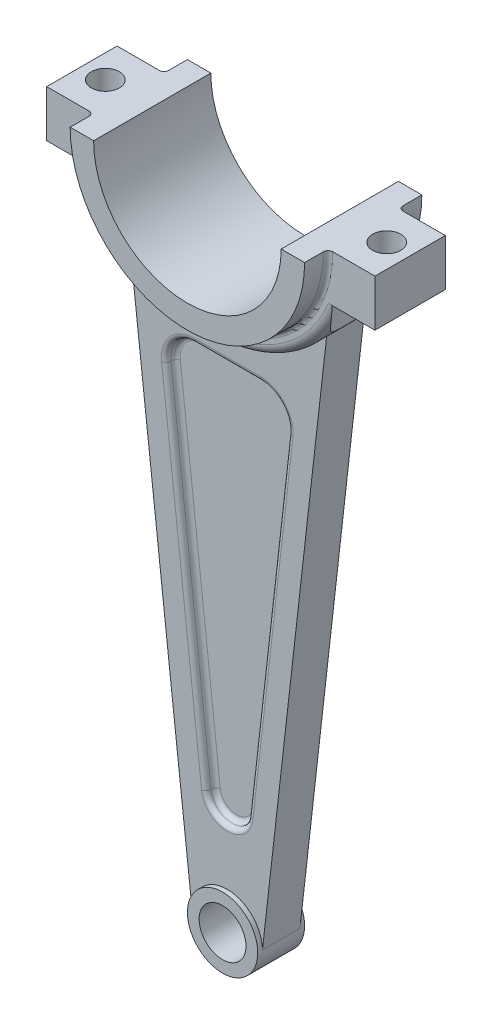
ISO-10303-21;
HEADER;
FILE_DESCRIPTION(('STEP AP214'),'2;1');
FILE_NAME('part.step','',(''),(''),'','','');
FILE_SCHEMA(('AUTOMOTIVE_DESIGN { 1 0 10303 214 1 1 1 1 }'));
ENDSEC;
DATA;
#1=APPLICATION_CONTEXT('core data for automotive mechanical design processes');
#2=APPLICATION_PROTOCOL_DEFINITION('international standard','automotive_design',2000,#1);
#3=PRODUCT_CONTEXT('',#1,'mechanical');
#4=PRODUCT('Part','Part','',(#3));
#5=PRODUCT_RELATED_PRODUCT_CATEGORY('part','',(#4));
#6=PRODUCT_DEFINITION_FORMATION('','',#4);
#7=PRODUCT_DEFINITION_CONTEXT('part definition',#1,'design');
#8=PRODUCT_DEFINITION('design','',#6,#7);
#9=PRODUCT_DEFINITION_SHAPE('','',#8);
#10=(LENGTH_UNIT() NAMED_UNIT(*) SI_UNIT(.MILLI.,.METRE.));
#11=(NAMED_UNIT(*) PLANE_ANGLE_UNIT() SI_UNIT($,.RADIAN.));
#12=(NAMED_UNIT(*) SI_UNIT($,.STERADIAN.) SOLID_ANGLE_UNIT());
#13=UNCERTAINTY_MEASURE_WITH_UNIT(LENGTH_MEASURE(1.E-05),#10,'distance_accuracy_value','');
#14=(GEOMETRIC_REPRESENTATION_CONTEXT(3) GLOBAL_UNCERTAINTY_ASSIGNED_CONTEXT((#13)) GLOBAL_UNIT_ASSIGNED_CONTEXT((#10,
#11,#12)) REPRESENTATION_CONTEXT('',''));
#15=CARTESIAN_POINT('',(0.,0.,0.));
#16=DIRECTION('',(0.,0.,1.));
#17=DIRECTION('',(1.,0.,0.));
#18=AXIS2_PLACEMENT_3D('',#15,#16,#17);
#19=CARTESIAN_POINT('',(0.,-280.,8.));
#20=DIRECTION('',(0.,0.,1.));
#21=DIRECTION('',(1.,0.,0.));
#22=AXIS2_PLACEMENT_3D('',#19,#20,#21);
#23=PLANE('',#22);
#24=DIRECTION('',(1.,0.,0.));
#25=VECTOR('',#24,1.);
#26=CARTESIAN_POINT('',(0.,-68.4911950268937,8.));
#27=LINE('',#26,#25);
#28=CARTESIAN_POINT('',(-14.077137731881,-68.4911950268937,8.));
#29=VERTEX_POINT('',#28);
#30=CARTESIAN_POINT('',(14.077137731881,-68.4911950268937,8.));
#31=VERTEX_POINT('',#30);
#32=EDGE_CURVE('E58',#29,#31,#27,.T.);
#33=ORIENTED_EDGE('',*,*,#32,.T.);
#34=CARTESIAN_POINT('',(14.077137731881,-82.4911950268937,8.));
#35=DIRECTION('',(0.,0.,1.));
#36=DIRECTION('',(1.,0.,0.));
#37=AXIS2_PLACEMENT_3D('',#34,#35,#36);
#38=CIRCLE('',#37,14.);
#39=CARTESIAN_POINT('',(27.9871437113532,-84.0760400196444,8.));
#40=VERTEX_POINT('',#39);
#41=EDGE_CURVE('E12',#31,#40,#38,.F.);
#42=ORIENTED_EDGE('',*,*,#41,.T.);
#43=DIRECTION('',(-0.113203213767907,-0.993571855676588,0.));
#44=VECTOR('',#43,1.);
#45=CARTESIAN_POINT('',(5.59183868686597,-280.637109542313,8.));
#46=LINE('',#45,#44);
#47=CARTESIAN_POINT('',(10.9292904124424,-233.790896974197,8.));
#48=VERTEX_POINT('',#47);
#49=EDGE_CURVE('E648',#40,#48,#46,.T.);
#50=ORIENTED_EDGE('',*,*,#49,.T.);
#51=CARTESIAN_POINT('',(0.,-232.54566162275,8.));
#52=DIRECTION('',(0.,0.,1.));
#53=DIRECTION('',(1.,0.,0.));
#54=AXIS2_PLACEMENT_3D('',#51,#52,#53);
#55=CIRCLE('',#54,11.);
#56=CARTESIAN_POINT('',(-10.9292904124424,-233.790896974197,8.));
#57=VERTEX_POINT('',#56);
#58=EDGE_CURVE('E666',#48,#57,#55,.F.);
#59=ORIENTED_EDGE('',*,*,#58,.T.);
#60=DIRECTION('',(-0.113203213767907,0.993571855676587,0.));
#61=VECTOR('',#60,1.);
#62=CARTESIAN_POINT('',(-5.59183868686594,-280.637109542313,8.));
#63=LINE('',#62,#61);
#64=CARTESIAN_POINT('',(-27.9871437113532,-84.0760400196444,8.));
#65=VERTEX_POINT('',#64);
#66=EDGE_CURVE('E668',#57,#65,#63,.T.);
#67=ORIENTED_EDGE('',*,*,#66,.T.);
#68=CARTESIAN_POINT('',(-14.077137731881,-82.4911950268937,8.));
#69=DIRECTION('',(0.,0.,1.));
#70=DIRECTION('',(1.,0.,0.));
#71=AXIS2_PLACEMENT_3D('',#68,#69,#70);
#72=CIRCLE('',#71,14.);
#73=EDGE_CURVE('E69',#65,#29,#72,.F.);
#74=ORIENTED_EDGE('',*,*,#73,.T.);
#75=EDGE_LOOP('',(#33,#42,#50,#59,#67,#74));
#76=FACE_BOUND('',#75,.T.);
#77=CARTESIAN_POINT('',(0.,-280.,8.));
#78=DIRECTION('',(0.,0.,-1.));
#79=DIRECTION('',(1.,0.,0.));
#80=AXIS2_PLACEMENT_3D('',#77,#78,#79);
#81=CIRCLE('',#80,15.);
#82=CARTESIAN_POINT('',(-15.,-280.,8.));
#83=VERTEX_POINT('',#82);
#84=CARTESIAN_POINT('',(15.,-280.,8.));
#85=VERTEX_POINT('',#84);
#86=EDGE_CURVE('E345',#83,#85,#81,.T.);
#87=ORIENTED_EDGE('',*,*,#86,.T.);
#88=DIRECTION('',(0.113203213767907,0.993571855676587,0.));
#89=VECTOR('',#88,1.);
#90=CARTESIAN_POINT('',(15.,-280.,8.));
#91=LINE('',#90,#89);
#92=CARTESIAN_POINT('',(42.391893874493,-39.5844329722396,8.));
#93=VERTEX_POINT('',#92);
#94=EDGE_CURVE('E313',#85,#93,#91,.T.);
#95=ORIENTED_EDGE('',*,*,#94,.T.);
#96=CARTESIAN_POINT('',(0.,0.,8.));
#97=DIRECTION('',(0.,0.,-1.));
#98=DIRECTION('',(1.,0.,0.));
#99=AXIS2_PLACEMENT_3D('',#96,#97,#98);
#100=CIRCLE('',#99,58.);
#101=CARTESIAN_POINT('',(-42.391893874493,-39.5844329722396,8.));
#102=VERTEX_POINT('',#101);
#103=EDGE_CURVE('E762',#93,#102,#100,.T.);
#104=ORIENTED_EDGE('',*,*,#103,.T.);
#105=DIRECTION('',(0.113203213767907,-0.993571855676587,0.));
#106=VECTOR('',#105,1.);
#107=CARTESIAN_POINT('',(-15.,-280.,8.));
#108=LINE('',#107,#106);
#109=EDGE_CURVE('E339',#102,#83,#108,.T.);
#110=ORIENTED_EDGE('',*,*,#109,.T.);
#111=EDGE_LOOP('',(#87,#95,#104,#110));
#112=FACE_BOUND('',#111,.T.);
#113=ADVANCED_FACE('F49',(#76,#112),#23,.T.);
#114=CARTESIAN_POINT('',(0.,0.,15.));
#115=DIRECTION('',(0.,0.,-1.));
#116=DIRECTION('',(-1.,0.,0.));
#117=AXIS2_PLACEMENT_3D('',#114,#115,#116);
#118=CYLINDRICAL_SURFACE('',#117,58.);
#119=DIRECTION('',(0.,0.,-1.));
#120=VECTOR('',#119,1.);
#121=CARTESIAN_POINT('',(-42.391893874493,-39.5844329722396,8.));
#122=LINE('',#121,#120);
#123=CARTESIAN_POINT('',(-42.391893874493,-39.5844329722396,-8.));
#124=VERTEX_POINT('',#123);
#125=EDGE_CURVE('E347',#102,#124,#122,.T.);
#126=ORIENTED_EDGE('',*,*,#125,.F.);
#127=ORIENTED_EDGE('',*,*,#103,.F.);
#128=DIRECTION('',(0.,0.,-1.));
#129=VECTOR('',#128,1.);
#130=CARTESIAN_POINT('',(42.391893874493,-39.5844329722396,8.));
#131=LINE('',#130,#129);
#132=CARTESIAN_POINT('',(42.391893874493,-39.5844329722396,-8.));
#133=VERTEX_POINT('',#132);
#134=EDGE_CURVE('E319',#93,#133,#131,.T.);
#135=ORIENTED_EDGE('',*,*,#134,.T.);
#136=CARTESIAN_POINT('',(0.,0.,-8.));
#137=DIRECTION('',(0.,0.,-1.));
#138=DIRECTION('',(1.,0.,0.));
#139=AXIS2_PLACEMENT_3D('',#136,#137,#138);
#140=CIRCLE('',#139,58.);
#141=EDGE_CURVE('E327',#133,#124,#140,.T.);
#142=ORIENTED_EDGE('',*,*,#141,.T.);
#143=EDGE_LOOP('',(#126,#127,#135,#142));
#144=FACE_BOUND('',#143,.T.);
#145=CARTESIAN_POINT('',(52.,-25.6904651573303,15.));
#146=CARTESIAN_POINT('',(51.8464410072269,-26.0012966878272,14.9180901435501));
#147=CARTESIAN_POINT('',(51.6905222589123,-26.3098603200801,14.8319155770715));
#148=CARTESIAN_POINT('',(51.3743247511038,-26.9220597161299,14.6502925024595));
#149=CARTESIAN_POINT('',(51.2140451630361,-27.2256945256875,14.5548422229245));
#150=CARTESIAN_POINT('',(50.8891075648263,-27.8283353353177,14.3536834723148));
#151=CARTESIAN_POINT('',(50.7244389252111,-28.127326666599,14.2479480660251));
#152=CARTESIAN_POINT('',(50.3916528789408,-28.7192737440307,14.025679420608));
#153=CARTESIAN_POINT('',(50.2235356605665,-29.0122298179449,13.9091467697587));
#154=CARTESIAN_POINT('',(49.7104094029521,-29.8887420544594,13.5389800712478));
#155=CARTESIAN_POINT('',(49.360814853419,-30.4621907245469,13.2673101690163));
#156=CARTESIAN_POINT('',(48.6559783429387,-31.5757674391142,12.6698951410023));
#157=CARTESIAN_POINT('',(48.3007436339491,-32.115934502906,12.3442150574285));
#158=CARTESIAN_POINT('',(47.7239295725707,-32.963370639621,11.7642584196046));
#159=CARTESIAN_POINT('',(47.5016328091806,-33.2827295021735,11.5282838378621));
#160=CARTESIAN_POINT('',(47.0604799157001,-33.9036295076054,11.0308360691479));
#161=CARTESIAN_POINT('',(46.8416239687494,-34.2051697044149,10.7693615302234));
#162=CARTESIAN_POINT('',(46.4112812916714,-34.7868273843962,10.2209439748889));
#163=CARTESIAN_POINT('',(46.1997677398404,-35.0670286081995,9.93411119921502));
#164=CARTESIAN_POINT('',(45.7865955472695,-35.6048113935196,9.33337846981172));
#165=CARTESIAN_POINT('',(45.5849352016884,-35.862396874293,9.01948322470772));
#166=CARTESIAN_POINT('',(45.2260091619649,-36.3136017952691,8.41618811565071));
#167=CARTESIAN_POINT('',(45.066755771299,-36.5109043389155,8.13072465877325));
#168=CARTESIAN_POINT('',(44.7604376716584,-36.8857939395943,7.54096141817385));
#169=CARTESIAN_POINT('',(44.6133704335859,-37.0633850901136,7.2366655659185));
#170=CARTESIAN_POINT('',(44.3338642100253,-37.3972719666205,6.6098417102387));
#171=CARTESIAN_POINT('',(44.2014350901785,-37.5535533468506,6.28730162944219));
#172=CARTESIAN_POINT('',(43.9538884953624,-37.8429911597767,5.62557308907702));
#173=CARTESIAN_POINT('',(43.8387711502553,-37.9761474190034,5.28638450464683));
#174=CARTESIAN_POINT('',(43.6275035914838,-38.2186738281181,4.59069644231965));
#175=CARTESIAN_POINT('',(43.531504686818,-38.3278548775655,4.23408469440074));
#176=CARTESIAN_POINT('',(43.3618321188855,-38.5197086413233,3.50857971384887));
#177=CARTESIAN_POINT('',(43.2881589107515,-38.6023808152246,3.13968623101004));
#178=CARTESIAN_POINT('',(43.1650248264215,-38.7400203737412,2.39304534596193));
#179=CARTESIAN_POINT('',(43.1155473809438,-38.7950067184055,2.01530418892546));
#180=CARTESIAN_POINT('',(43.0420315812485,-38.8765555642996,1.25433467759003));
#181=CARTESIAN_POINT('',(43.0179896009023,-38.9031221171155,0.871107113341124));
#182=CARTESIAN_POINT('',(42.9974413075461,-38.9258292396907,0.154406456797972));
#183=CARTESIAN_POINT('',(42.9976832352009,-38.9255628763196,-0.178868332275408));
#184=CARTESIAN_POINT('',(43.0177090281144,-38.9034310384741,-0.844086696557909));
#185=CARTESIAN_POINT('',(43.0374907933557,-38.8815678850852,-1.17603041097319));
#186=CARTESIAN_POINT('',(43.0961909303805,-38.8164943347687,-1.83602642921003));
#187=CARTESIAN_POINT('',(43.1351052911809,-38.773288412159,-2.1640795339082));
#188=CARTESIAN_POINT('',(43.2313017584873,-38.6660022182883,-2.81401500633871));
#189=CARTESIAN_POINT('',(43.2885841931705,-38.6019215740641,-3.13589726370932));
#190=CARTESIAN_POINT('',(43.4186894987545,-38.4555160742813,-3.76297559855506));
#191=CARTESIAN_POINT('',(43.4910639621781,-38.3737154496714,-4.06838787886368));
#192=CARTESIAN_POINT('',(43.6509444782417,-38.19174912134,-4.66959762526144));
#193=CARTESIAN_POINT('',(43.7384500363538,-38.0915840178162,-4.96539540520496));
#194=CARTESIAN_POINT('',(43.9271768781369,-37.8737887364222,-5.54594690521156));
#195=CARTESIAN_POINT('',(44.0283978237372,-37.7561589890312,-5.83070089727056));
#196=CARTESIAN_POINT('',(44.2430666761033,-37.5043788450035,-6.38813845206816));
#197=CARTESIAN_POINT('',(44.356519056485,-37.3702224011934,-6.66081754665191));
#198=CARTESIAN_POINT('',(44.6058099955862,-37.0724020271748,-7.21952137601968));
#199=CARTESIAN_POINT('',(44.7427528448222,-36.9071319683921,-7.50419817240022));
#200=CARTESIAN_POINT('',(45.0274090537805,-36.559309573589,-8.05719278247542));
#201=CARTESIAN_POINT('',(45.1751266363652,-36.3767504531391,-8.32550410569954));
#202=CARTESIAN_POINT('',(45.6313417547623,-35.8052657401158,-9.10515657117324));
#203=CARTESIAN_POINT('',(45.9530506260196,-35.392357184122,-9.59154106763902));
#204=CARTESIAN_POINT('',(46.5506820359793,-34.6010061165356,-10.4076433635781));
#205=CARTESIAN_POINT('',(46.8230636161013,-34.2319181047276,-10.7493154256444));
#206=CARTESIAN_POINT('',(47.3746924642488,-33.4643354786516,-11.3921436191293));
#207=CARTESIAN_POINT('',(47.6539433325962,-33.0658252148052,-11.6932779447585));
#208=CARTESIAN_POINT('',(48.2149582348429,-32.2423191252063,-12.2585506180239));
#209=CARTESIAN_POINT('',(48.4967277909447,-31.8172281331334,-12.5225435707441));
#210=CARTESIAN_POINT('',(49.0574716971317,-30.9456443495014,-13.0153897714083));
#211=CARTESIAN_POINT('',(49.3364466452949,-30.4991562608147,-13.2442506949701));
#212=CARTESIAN_POINT('',(49.8220028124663,-29.6973399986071,-13.619047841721));
#213=CARTESIAN_POINT('',(50.0298714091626,-29.3458875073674,-13.7716956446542));
#214=CARTESIAN_POINT('',(50.4409685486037,-28.6335081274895,-14.0601549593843));
#215=CARTESIAN_POINT('',(50.6441972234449,-28.2725815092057,-14.1959669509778));
#216=CARTESIAN_POINT('',(51.0432010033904,-27.5456328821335,-14.4509983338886));
#217=CARTESIAN_POINT('',(51.2390274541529,-27.1796882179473,-14.5703587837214));
#218=CARTESIAN_POINT('',(51.624395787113,-26.4404214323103,-14.7952288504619));
#219=CARTESIAN_POINT('',(51.8139391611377,-26.0671010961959,-14.9007417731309));
#220=CARTESIAN_POINT('',(52.,-25.6904651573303,-15.));
#221=B_SPLINE_CURVE_WITH_KNOTS('',3,(#145,#146,#147,#148,#149,#150,#151,#152,#153,#154,#155,
#156,#157,#158,#159,#160,#161,#162,#163,#164,#165,#166,#167,#168,#169,#170,#171,#172,#173,#174,
#175,#176,#177,#178,#179,#180,#181,#182,#183,#184,#185,#186,#187,#188,#189,#190,#191,#192,#193,
#194,#195,#196,#197,#198,#199,#200,#201,#202,#203,#204,#205,#206,#207,#208,#209,#210,#211,#212,
#213,#214,#215,#216,#217,#218,#219,#220),.UNSPECIFIED.,.F.,.F.,(4,2,2,2,2,2,2,2,2,2,2,2,2,2,2,2,
2,2,2,2,2,2,2,2,2,2,2,2,2,2,2,2,2,2,2,2,2,4),(0.,1.06870145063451,2.13760739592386,
3.20939213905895,4.28111852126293,6.45200584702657,8.62029759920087,9.98458948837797,
11.3489537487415,12.7076537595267,14.0661178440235,15.2104802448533,16.354604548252,
17.4994953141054,18.6443946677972,19.7980234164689,20.9516756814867,22.1045368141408,
23.2572335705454,24.2558143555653,25.2542878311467,26.2525520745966,27.2508341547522,
28.2228575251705,29.1948491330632,30.1668167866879,31.139141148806,32.207644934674,
33.2765697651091,35.4132354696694,37.1269886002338,38.8416599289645,40.5628671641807,
42.2836978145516,43.5910217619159,44.89830844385,46.1935772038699,47.4885361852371),.UNSPECIFIED.);
#222=CARTESIAN_POINT('',(47.0385186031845,-33.9319579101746,11.0000000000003));
#223=VERTEX_POINT('',#222);
#224=CARTESIAN_POINT('',(47.0385186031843,-33.931957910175,-11.));
#225=VERTEX_POINT('',#224);
#226=EDGE_CURVE('E353',#223,#225,#221,.T.);
#227=ORIENTED_EDGE('',*,*,#226,.F.);
#228=CARTESIAN_POINT('',(0.,0.,11.));
#229=DIRECTION('',(0.,0.,1.));
#230=DIRECTION('',(1.,0.,0.));
#231=AXIS2_PLACEMENT_3D('',#228,#229,#230);
#232=CIRCLE('',#231,58.);
#233=CARTESIAN_POINT('',(-47.0385186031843,-33.931957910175,11.));
#234=VERTEX_POINT('',#233);
#235=EDGE_CURVE('E514',#223,#234,#232,.F.);
#236=ORIENTED_EDGE('',*,*,#235,.T.);
#237=CARTESIAN_POINT('',(-52.,-25.6904651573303,-15.));
#238=CARTESIAN_POINT('',(-51.8464410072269,-26.0012966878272,-14.9180901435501));
#239=CARTESIAN_POINT('',(-51.6905222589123,-26.3098603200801,-14.8319155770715));
#240=CARTESIAN_POINT('',(-51.3743247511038,-26.9220597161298,-14.6502925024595));
#241=CARTESIAN_POINT('',(-51.2140451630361,-27.2256945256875,-14.5548422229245));
#242=CARTESIAN_POINT('',(-50.8891075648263,-27.8283353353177,-14.3536834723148));
#243=CARTESIAN_POINT('',(-50.7244389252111,-28.127326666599,-14.2479480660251));
#244=CARTESIAN_POINT('',(-50.3916528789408,-28.7192737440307,-14.025679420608));
#245=CARTESIAN_POINT('',(-50.2235356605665,-29.0122298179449,-13.9091467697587));
#246=CARTESIAN_POINT('',(-49.7104094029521,-29.8887420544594,-13.5389800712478));
#247=CARTESIAN_POINT('',(-49.360814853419,-30.4621907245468,-13.2673101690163));
#248=CARTESIAN_POINT('',(-48.6559783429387,-31.5757674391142,-12.6698951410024));
#249=CARTESIAN_POINT('',(-48.3007436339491,-32.115934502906,-12.3442150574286));
#250=CARTESIAN_POINT('',(-47.7239295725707,-32.963370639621,-11.7642584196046));
#251=CARTESIAN_POINT('',(-47.5016328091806,-33.2827295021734,-11.5282838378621));
#252=CARTESIAN_POINT('',(-47.0604799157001,-33.9036295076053,-11.0308360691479));
#253=CARTESIAN_POINT('',(-46.8416239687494,-34.2051697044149,-10.7693615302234));
#254=CARTESIAN_POINT('',(-46.4112812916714,-34.7868273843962,-10.2209439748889));
#255=CARTESIAN_POINT('',(-46.1997677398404,-35.0670286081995,-9.93411119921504));
#256=CARTESIAN_POINT('',(-45.7865955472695,-35.6048113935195,-9.33337846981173));
#257=CARTESIAN_POINT('',(-45.5849352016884,-35.862396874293,-9.01948322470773));
#258=CARTESIAN_POINT('',(-45.226009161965,-36.3136017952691,-8.41618811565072));
#259=CARTESIAN_POINT('',(-45.066755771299,-36.5109043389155,-8.13072465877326));
#260=CARTESIAN_POINT('',(-44.7604376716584,-36.8857939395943,-7.54096141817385));
#261=CARTESIAN_POINT('',(-44.6133704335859,-37.0633850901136,-7.23666556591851));
#262=CARTESIAN_POINT('',(-44.3338642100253,-37.3972719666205,-6.60984171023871));
#263=CARTESIAN_POINT('',(-44.2014350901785,-37.5535533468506,-6.2873016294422));
#264=CARTESIAN_POINT('',(-43.9538884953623,-37.8429911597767,-5.62557308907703));
#265=CARTESIAN_POINT('',(-43.8387711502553,-37.9761474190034,-5.28638450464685));
#266=CARTESIAN_POINT('',(-43.6275035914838,-38.2186738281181,-4.59069644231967));
#267=CARTESIAN_POINT('',(-43.531504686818,-38.3278548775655,-4.23408469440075));
#268=CARTESIAN_POINT('',(-43.3618321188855,-38.5197086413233,-3.50857971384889));
#269=CARTESIAN_POINT('',(-43.2881589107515,-38.6023808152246,-3.13968623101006));
#270=CARTESIAN_POINT('',(-43.1650248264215,-38.7400203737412,-2.39304534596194));
#271=CARTESIAN_POINT('',(-43.1155473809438,-38.7950067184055,-2.01530418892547));
#272=CARTESIAN_POINT('',(-43.0420315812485,-38.8765555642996,-1.25433467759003));
#273=CARTESIAN_POINT('',(-43.0179896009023,-38.9031221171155,-0.871107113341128));
#274=CARTESIAN_POINT('',(-42.9974413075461,-38.9258292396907,-0.154406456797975));
#275=CARTESIAN_POINT('',(-42.9976832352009,-38.9255628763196,0.178868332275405));
#276=CARTESIAN_POINT('',(-43.0177090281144,-38.9034310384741,0.844086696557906));
#277=CARTESIAN_POINT('',(-43.0374907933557,-38.8815678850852,1.17603041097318));
#278=CARTESIAN_POINT('',(-43.0961909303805,-38.8164943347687,1.83602642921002));
#279=CARTESIAN_POINT('',(-43.1351052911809,-38.773288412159,2.1640795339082));
#280=CARTESIAN_POINT('',(-43.2313017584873,-38.6660022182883,2.81401500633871));
#281=CARTESIAN_POINT('',(-43.2885841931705,-38.6019215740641,3.13589726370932));
#282=CARTESIAN_POINT('',(-43.4186894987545,-38.4555160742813,3.76297559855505));
#283=CARTESIAN_POINT('',(-43.4910639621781,-38.3737154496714,4.06838787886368));
#284=CARTESIAN_POINT('',(-43.6509444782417,-38.19174912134,4.66959762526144));
#285=CARTESIAN_POINT('',(-43.7384500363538,-38.0915840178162,4.96539540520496));
#286=CARTESIAN_POINT('',(-43.9271768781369,-37.8737887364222,5.54594690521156));
#287=CARTESIAN_POINT('',(-44.0283978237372,-37.7561589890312,5.83070089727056));
#288=CARTESIAN_POINT('',(-44.2430666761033,-37.5043788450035,6.38813845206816));
#289=CARTESIAN_POINT('',(-44.356519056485,-37.3702224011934,6.6608175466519));
#290=CARTESIAN_POINT('',(-44.6058099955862,-37.0724020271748,7.21952137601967));
#291=CARTESIAN_POINT('',(-44.7427528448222,-36.9071319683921,7.50419817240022));
#292=CARTESIAN_POINT('',(-45.0274090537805,-36.559309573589,8.05719278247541));
#293=CARTESIAN_POINT('',(-45.1751266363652,-36.3767504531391,8.32550410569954));
#294=CARTESIAN_POINT('',(-45.6313417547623,-35.8052657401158,9.10515657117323));
#295=CARTESIAN_POINT('',(-45.9530506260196,-35.392357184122,9.59154106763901));
#296=CARTESIAN_POINT('',(-46.5506820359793,-34.6010061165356,10.4076433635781));
#297=CARTESIAN_POINT('',(-46.8230636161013,-34.2319181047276,10.7493154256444));
#298=CARTESIAN_POINT('',(-47.3746924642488,-33.4643354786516,11.3921436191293));
#299=CARTESIAN_POINT('',(-47.6539433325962,-33.0658252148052,11.6932779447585));
#300=CARTESIAN_POINT('',(-48.2149582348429,-32.2423191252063,12.2585506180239));
#301=CARTESIAN_POINT('',(-48.4967277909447,-31.8172281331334,12.5225435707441));
#302=CARTESIAN_POINT('',(-49.0574716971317,-30.9456443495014,13.0153897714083));
#303=CARTESIAN_POINT('',(-49.3364466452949,-30.4991562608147,13.2442506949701));
#304=CARTESIAN_POINT('',(-49.8220028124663,-29.6973399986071,13.619047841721));
#305=CARTESIAN_POINT('',(-50.0298714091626,-29.3458875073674,13.7716956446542));
#306=CARTESIAN_POINT('',(-50.4409685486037,-28.6335081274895,14.0601549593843));
#307=CARTESIAN_POINT('',(-50.6441972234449,-28.2725815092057,14.1959669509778));
#308=CARTESIAN_POINT('',(-51.0432010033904,-27.5456328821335,14.4509983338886));
#309=CARTESIAN_POINT('',(-51.2390274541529,-27.1796882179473,14.5703587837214));
#310=CARTESIAN_POINT('',(-51.624395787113,-26.4404214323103,14.7952288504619));
#311=CARTESIAN_POINT('',(-51.8139391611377,-26.0671010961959,14.9007417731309));
#312=CARTESIAN_POINT('',(-52.,-25.6904651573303,15.));
#313=B_SPLINE_CURVE_WITH_KNOTS('',3,(#237,#238,#239,#240,#241,#242,#243,#244,#245,#246,#247,
#248,#249,#250,#251,#252,#253,#254,#255,#256,#257,#258,#259,#260,#261,#262,#263,#264,#265,#266,
#267,#268,#269,#270,#271,#272,#273,#274,#275,#276,#277,#278,#279,#280,#281,#282,#283,#284,#285,
#286,#287,#288,#289,#290,#291,#292,#293,#294,#295,#296,#297,#298,#299,#300,#301,#302,#303,#304,
#305,#306,#307,#308,#309,#310,#311,#312),.UNSPECIFIED.,.F.,.F.,(4,2,2,2,2,2,2,2,2,2,2,2,2,2,2,2,
2,2,2,2,2,2,2,2,2,2,2,2,2,2,2,2,2,2,2,2,2,4),(0.,1.06870145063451,2.13760739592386,
3.20939213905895,4.28111852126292,6.45200584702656,8.62029759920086,9.98458948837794,
11.3489537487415,12.7076537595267,14.0661178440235,15.2104802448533,16.354604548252,
17.4994953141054,18.6443946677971,19.7980234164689,20.9516756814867,22.1045368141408,
23.2572335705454,24.2558143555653,25.2542878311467,26.2525520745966,27.2508341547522,
28.2228575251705,29.1948491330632,30.1668167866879,31.139141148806,32.207644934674,
33.2765697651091,35.4132354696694,37.1269886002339,38.8416599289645,40.5628671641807,
42.2836978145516,43.5910217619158,44.89830844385,46.1935772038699,47.4885361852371),.UNSPECIFIED.);
#314=CARTESIAN_POINT('',(-47.0385186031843,-33.931957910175,-11.));
#315=VERTEX_POINT('',#314);
#316=EDGE_CURVE('E465',#315,#234,#313,.T.);
#317=ORIENTED_EDGE('',*,*,#316,.F.);
#318=CARTESIAN_POINT('',(0.,0.,-11.));
#319=DIRECTION('',(0.,0.,1.));
#320=DIRECTION('',(1.,0.,0.));
#321=AXIS2_PLACEMENT_3D('',#318,#319,#320);
#322=CIRCLE('',#321,58.);
#323=EDGE_CURVE('E510',#315,#225,#322,.T.);
#324=ORIENTED_EDGE('',*,*,#323,.T.);
#325=EDGE_LOOP('',(#227,#236,#317,#324));
#326=FACE_BOUND('',#325,.T.);
#327=ADVANCED_FACE('F363',(#144,#326),#118,.T.);
#328=CARTESIAN_POINT('',(0.,0.,15.));
#329=DIRECTION('',(0.,0.,1.));
#330=DIRECTION('',(1.,0.,0.));
#331=AXIS2_PLACEMENT_3D('',#328,#329,#330);
#332=PLANE('',#331);
#333=DIRECTION('',(1.,0.,0.));
#334=VECTOR('',#333,1.);
#335=CARTESIAN_POINT('',(0.,0.,15.));
#336=LINE('',#335,#334);
#337=CARTESIAN_POINT('',(52.,0.,15.));
#338=VERTEX_POINT('',#337);
#339=CARTESIAN_POINT('',(70.,0.,15.));
#340=VERTEX_POINT('',#339);
#341=EDGE_CURVE('E1293',#338,#340,#336,.T.);
#342=ORIENTED_EDGE('',*,*,#341,.F.);
#343=CARTESIAN_POINT('',(0.,0.,15.));
#344=DIRECTION('',(0.,0.,1.));
#345=DIRECTION('',(1.,0.,0.));
#346=AXIS2_PLACEMENT_3D('',#343,#344,#345);
#347=CIRCLE('',#346,52.);
#348=CARTESIAN_POINT('',(-52.,0.,15.));
#349=VERTEX_POINT('',#348);
#350=EDGE_CURVE('E529',#338,#349,#347,.F.);
#351=ORIENTED_EDGE('',*,*,#350,.T.);
#352=DIRECTION('',(1.,0.,0.));
#353=VECTOR('',#352,1.);
#354=CARTESIAN_POINT('',(0.,0.,15.));
#355=LINE('',#354,#353);
#356=CARTESIAN_POINT('',(-70.,0.,15.));
#357=VERTEX_POINT('',#356);
#358=EDGE_CURVE('E1289',#357,#349,#355,.T.);
#359=ORIENTED_EDGE('',*,*,#358,.F.);
#360=DIRECTION('',(0.,-1.,0.));
#361=VECTOR('',#360,1.);
#362=CARTESIAN_POINT('',(-70.,0.,15.));
#363=LINE('',#362,#361);
#364=CARTESIAN_POINT('',(-70.,-20.,15.));
#365=VERTEX_POINT('',#364);
#366=EDGE_CURVE('E1274',#357,#365,#363,.T.);
#367=ORIENTED_EDGE('',*,*,#366,.T.);
#368=DIRECTION('',(1.,0.,0.));
#369=VECTOR('',#368,1.);
#370=CARTESIAN_POINT('',(0.,-20.,15.));
#371=LINE('',#370,#369);
#372=CARTESIAN_POINT('',(-50.1597448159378,-20.,15.));
#373=VERTEX_POINT('',#372);
#374=EDGE_CURVE('E494',#365,#373,#371,.T.);
#375=ORIENTED_EDGE('',*,*,#374,.T.);
#376=CARTESIAN_POINT('',(0.,0.,15.));
#377=DIRECTION('',(0.,0.,1.));
#378=DIRECTION('',(1.,0.,0.));
#379=AXIS2_PLACEMENT_3D('',#376,#377,#378);
#380=CIRCLE('',#379,54.);
#381=CARTESIAN_POINT('',(50.1597448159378,-20.,15.));
#382=VERTEX_POINT('',#381);
#383=EDGE_CURVE('E388',#373,#382,#380,.T.);
#384=ORIENTED_EDGE('',*,*,#383,.T.);
#385=DIRECTION('',(-1.,0.,0.));
#386=VECTOR('',#385,1.);
#387=CARTESIAN_POINT('',(0.,-20.,15.));
#388=LINE('',#387,#386);
#389=CARTESIAN_POINT('',(70.,-20.,15.));
#390=VERTEX_POINT('',#389);
#391=EDGE_CURVE('E490',#390,#382,#388,.T.);
#392=ORIENTED_EDGE('',*,*,#391,.F.);
#393=DIRECTION('',(0.,-1.,0.));
#394=VECTOR('',#393,1.);
#395=CARTESIAN_POINT('',(70.,0.,15.));
#396=LINE('',#395,#394);
#397=EDGE_CURVE('E1295',#340,#390,#396,.T.);
#398=ORIENTED_EDGE('',*,*,#397,.F.);
#399=EDGE_LOOP('',(#342,#351,#359,#367,#375,#384,#392,#398));
#400=FACE_BOUND('',#399,.T.);
#401=ADVANCED_FACE('F488',(#400),#332,.T.);
#402=CARTESIAN_POINT('',(0.,0.,-15.));
#403=DIRECTION('',(0.,0.,1.));
#404=DIRECTION('',(1.,0.,0.));
#405=AXIS2_PLACEMENT_3D('',#402,#403,#404);
#406=PLANE('',#405);
#407=DIRECTION('',(1.,0.,0.));
#408=VECTOR('',#407,1.);
#409=CARTESIAN_POINT('',(0.,0.,-15.));
#410=LINE('',#409,#408);
#411=CARTESIAN_POINT('',(-70.,0.,-15.));
#412=VERTEX_POINT('',#411);
#413=CARTESIAN_POINT('',(-52.,0.,-15.));
#414=VERTEX_POINT('',#413);
#415=EDGE_CURVE('E1267',#412,#414,#410,.T.);
#416=ORIENTED_EDGE('',*,*,#415,.T.);
#417=CARTESIAN_POINT('',(0.,0.,-15.));
#418=DIRECTION('',(0.,0.,1.));
#419=DIRECTION('',(1.,0.,0.));
#420=AXIS2_PLACEMENT_3D('',#417,#418,#419);
#421=CIRCLE('',#420,52.);
#422=CARTESIAN_POINT('',(52.,0.,-15.));
#423=VERTEX_POINT('',#422);
#424=EDGE_CURVE('E517',#414,#423,#421,.T.);
#425=ORIENTED_EDGE('',*,*,#424,.T.);
#426=DIRECTION('',(1.,0.,0.));
#427=VECTOR('',#426,1.);
#428=CARTESIAN_POINT('',(0.,0.,-15.));
#429=LINE('',#428,#427);
#430=CARTESIAN_POINT('',(70.,0.,-15.));
#431=VERTEX_POINT('',#430);
#432=EDGE_CURVE('E1273',#423,#431,#429,.T.);
#433=ORIENTED_EDGE('',*,*,#432,.T.);
#434=DIRECTION('',(0.,-1.,0.));
#435=VECTOR('',#434,1.);
#436=CARTESIAN_POINT('',(70.,0.,-15.));
#437=LINE('',#436,#435);
#438=CARTESIAN_POINT('',(70.,-20.,-15.));
#439=VERTEX_POINT('',#438);
#440=EDGE_CURVE('E1276',#431,#439,#437,.T.);
#441=ORIENTED_EDGE('',*,*,#440,.T.);
#442=DIRECTION('',(-1.,0.,0.));
#443=VECTOR('',#442,1.);
#444=CARTESIAN_POINT('',(0.,-20.,-15.));
#445=LINE('',#444,#443);
#446=CARTESIAN_POINT('',(50.1597448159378,-20.,-15.));
#447=VERTEX_POINT('',#446);
#448=EDGE_CURVE('E1284',#439,#447,#445,.T.);
#449=ORIENTED_EDGE('',*,*,#448,.T.);
#450=CARTESIAN_POINT('',(0.,0.,-15.));
#451=DIRECTION('',(0.,0.,1.));
#452=DIRECTION('',(1.,0.,0.));
#453=AXIS2_PLACEMENT_3D('',#450,#451,#452);
#454=CIRCLE('',#453,54.);
#455=CARTESIAN_POINT('',(-50.1597448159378,-20.,-15.));
#456=VERTEX_POINT('',#455);
#457=EDGE_CURVE('E449',#447,#456,#454,.F.);
#458=ORIENTED_EDGE('',*,*,#457,.T.);
#459=DIRECTION('',(1.,0.,0.));
#460=VECTOR('',#459,1.);
#461=CARTESIAN_POINT('',(0.,-20.,-15.));
#462=LINE('',#461,#460);
#463=CARTESIAN_POINT('',(-70.,-20.,-15.));
#464=VERTEX_POINT('',#463);
#465=EDGE_CURVE('E1286',#464,#456,#462,.T.);
#466=ORIENTED_EDGE('',*,*,#465,.F.);
#467=DIRECTION('',(0.,-1.,0.));
#468=VECTOR('',#467,1.);
#469=CARTESIAN_POINT('',(-70.,0.,-15.));
#470=LINE('',#469,#468);
#471=EDGE_CURVE('E1272',#412,#464,#470,.T.);
#472=ORIENTED_EDGE('',*,*,#471,.F.);
#473=EDGE_LOOP('',(#416,#425,#433,#441,#449,#458,#466,#472));
#474=FACE_BOUND('',#473,.T.);
#475=ADVANCED_FACE('F1115',(#474),#406,.F.);
#476=CARTESIAN_POINT('',(0.,-20.,15.));
#477=DIRECTION('',(0.,1.,0.));
#478=DIRECTION('',(-1.,0.,0.));
#479=AXIS2_PLACEMENT_3D('',#476,#477,#478);
#480=PLANE('',#479);
#481=ORIENTED_EDGE('',*,*,#465,.T.);
#482=CARTESIAN_POINT('',(-50.1597448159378,-20.,-15.));
#483=CARTESIAN_POINT('',(-50.281125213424,-20.,-15.0000055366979));
#484=CARTESIAN_POINT('',(-50.402508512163,-20.,-14.9952328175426));
#485=CARTESIAN_POINT('',(-50.6437660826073,-20.,-14.9762031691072));
#486=CARTESIAN_POINT('',(-50.7636450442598,-20.,-14.9620056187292));
#487=CARTESIAN_POINT('',(-51.0019188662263,-20.,-14.9241970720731));
#488=CARTESIAN_POINT('',(-51.1203136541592,-20.,-14.9005856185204));
#489=CARTESIAN_POINT('',(-51.3555850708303,-20.,-14.843841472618));
#490=CARTESIAN_POINT('',(-51.4724474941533,-20.,-14.8106499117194));
#491=CARTESIAN_POINT('',(-51.5877788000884,-20.,-14.7727632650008));
#492=B_SPLINE_CURVE_WITH_KNOTS('',3,(#482,#483,#484,#485,#486,#487,#488,#489,#490,#491),
.UNSPECIFIED.,.F.,.F.,(4,2,2,2,4),(0.,0.364051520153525,0.725830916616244,1.0876278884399,
1.45169719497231),.UNSPECIFIED.);
#493=CARTESIAN_POINT('',(-51.5877788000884,-20.,-14.7727632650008));
#494=VERTEX_POINT('',#493);
#495=EDGE_CURVE('E421',#456,#494,#492,.T.);
#496=ORIENTED_EDGE('',*,*,#495,.T.);
#497=CARTESIAN_POINT('',(-60.,-20.,0.));
#498=DIRECTION('',(0.,-1.,0.));
#499=DIRECTION('',(1.,0.,0.));
#500=AXIS2_PLACEMENT_3D('',#497,#498,#499);
#501=CIRCLE('',#500,17.);
#502=CARTESIAN_POINT('',(-51.5877788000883,-20.,14.7727632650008));
#503=VERTEX_POINT('',#502);
#504=EDGE_CURVE('E473',#494,#503,#501,.T.);
#505=ORIENTED_EDGE('',*,*,#504,.T.);
#506=CARTESIAN_POINT('',(-51.5877788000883,-20.,14.7727632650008));
#507=CARTESIAN_POINT('',(-51.4724474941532,-20.,14.8106499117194));
#508=CARTESIAN_POINT('',(-51.3555850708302,-20.,14.843841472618));
#509=CARTESIAN_POINT('',(-51.1203136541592,-20.,14.9005856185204));
#510=CARTESIAN_POINT('',(-51.0019188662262,-20.,14.9241970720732));
#511=CARTESIAN_POINT('',(-50.7636450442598,-20.,14.9620056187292));
#512=CARTESIAN_POINT('',(-50.6437660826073,-20.,14.9762031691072));
#513=CARTESIAN_POINT('',(-50.4025085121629,-20.,14.9952328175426));
#514=CARTESIAN_POINT('',(-50.2811252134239,-20.,15.0000055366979));
#515=CARTESIAN_POINT('',(-50.1597448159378,-20.,15.));
#516=B_SPLINE_CURVE_WITH_KNOTS('',3,(#506,#507,#508,#509,#510,#511,#512,#513,#514,#515),
.UNSPECIFIED.,.F.,.F.,(4,2,2,2,4),(0.,0.364069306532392,0.725866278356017,1.08764567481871,
1.4516971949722),.UNSPECIFIED.);
#517=EDGE_CURVE('E422',#503,#373,#516,.T.);
#518=ORIENTED_EDGE('',*,*,#517,.T.);
#519=ORIENTED_EDGE('',*,*,#374,.F.);
#520=DIRECTION('',(0.,0.,-1.));
#521=VECTOR('',#520,1.);
#522=CARTESIAN_POINT('',(-70.,-20.,15.));
#523=LINE('',#522,#521);
#524=EDGE_CURVE('E1287',#365,#464,#523,.T.);
#525=ORIENTED_EDGE('',*,*,#524,.T.);
#526=EDGE_LOOP('',(#481,#496,#505,#518,#519,#525));
#527=FACE_BOUND('',#526,.T.);
#528=CARTESIAN_POINT('',(-60.,-20.,0.));
#529=DIRECTION('',(0.,-1.,0.));
#530=DIRECTION('',(1.,0.,0.));
#531=AXIS2_PLACEMENT_3D('',#528,#529,#530);
#532=CIRCLE('',#531,6.);
#533=CARTESIAN_POINT('',(-54.,-20.,0.));
#534=VERTEX_POINT('',#533);
#535=EDGE_CURVE('E478',#534,#534,#532,.T.);
#536=ORIENTED_EDGE('',*,*,#535,.F.);
#537=EDGE_LOOP('',(#536));
#538=FACE_BOUND('',#537,.T.);
#539=ADVANCED_FACE('F439',(#527,#538),#480,.F.);
#540=CARTESIAN_POINT('',(0.,0.,25.));
#541=DIRECTION('',(0.,0.,-1.));
#542=DIRECTION('',(-1.,0.,0.));
#543=AXIS2_PLACEMENT_3D('',#540,#541,#542);
#544=CYLINDRICAL_SURFACE('',#543,50.);
#545=DIRECTION('',(0.,0.,-1.));
#546=VECTOR('',#545,1.);
#547=CARTESIAN_POINT('',(50.,0.,25.));
#548=LINE('',#547,#546);
#549=CARTESIAN_POINT('',(50.,0.,-17.));
#550=VERTEX_POINT('',#549);
#551=CARTESIAN_POINT('',(50.,0.,-25.));
#552=VERTEX_POINT('',#551);
#553=EDGE_CURVE('E1251',#550,#552,#548,.T.);
#554=ORIENTED_EDGE('',*,*,#553,.F.);
#555=CARTESIAN_POINT('',(0.,0.,-17.));
#556=DIRECTION('',(0.,0.,1.));
#557=DIRECTION('',(1.,0.,0.));
#558=AXIS2_PLACEMENT_3D('',#555,#556,#557);
#559=CIRCLE('',#558,50.);
#560=CARTESIAN_POINT('',(-50.,0.,-17.));
#561=VERTEX_POINT('',#560);
#562=EDGE_CURVE('E519',#550,#561,#559,.F.);
#563=ORIENTED_EDGE('',*,*,#562,.T.);
#564=DIRECTION('',(0.,0.,-1.));
#565=VECTOR('',#564,1.);
#566=CARTESIAN_POINT('',(-50.,0.,25.));
#567=LINE('',#566,#565);
#568=CARTESIAN_POINT('',(-50.,0.,-25.));
#569=VERTEX_POINT('',#568);
#570=EDGE_CURVE('E1268',#561,#569,#567,.T.);
#571=ORIENTED_EDGE('',*,*,#570,.T.);
#572=CARTESIAN_POINT('',(0.,0.,-25.));
#573=DIRECTION('',(0.,0.,1.));
#574=DIRECTION('',(1.,0.,0.));
#575=AXIS2_PLACEMENT_3D('',#572,#573,#574);
#576=CIRCLE('',#575,50.);
#577=EDGE_CURVE('E1255',#569,#552,#576,.T.);
#578=ORIENTED_EDGE('',*,*,#577,.T.);
#579=EDGE_LOOP('',(#554,#563,#571,#578));
#580=FACE_BOUND('',#579,.T.);
#581=ADVANCED_FACE('F1142',(#580),#544,.T.);
#582=CARTESIAN_POINT('',(0.,0.,25.));
#583=DIRECTION('',(0.,1.,0.));
#584=DIRECTION('',(0.,0.,1.));
#585=AXIS2_PLACEMENT_3D('',#582,#583,#584);
#586=PLANE('',#585);
#587=CARTESIAN_POINT('',(-60.,0.,0.));
#588=DIRECTION('',(0.,1.,0.));
#589=DIRECTION('',(0.,0.,1.));
#590=AXIS2_PLACEMENT_3D('',#587,#588,#589);
#591=CIRCLE('',#590,6.);
#592=CARTESIAN_POINT('',(-60.,0.,6.));
#593=VERTEX_POINT('',#592);
#594=EDGE_CURVE('E474',#593,#593,#591,.T.);
#595=ORIENTED_EDGE('',*,*,#594,.F.);
#596=EDGE_LOOP('',(#595));
#597=FACE_BOUND('',#596,.T.);
#598=DIRECTION('',(1.,0.,0.));
#599=VECTOR('',#598,1.);
#600=CARTESIAN_POINT('',(0.,0.,-25.));
#601=LINE('',#600,#599);
#602=CARTESIAN_POINT('',(-40.,0.,-25.));
#603=VERTEX_POINT('',#602);
#604=EDGE_CURVE('E1302',#569,#603,#601,.T.);
#605=ORIENTED_EDGE('',*,*,#604,.F.);
#606=ORIENTED_EDGE('',*,*,#570,.F.);
#607=CARTESIAN_POINT('',(-52.,0.,-17.));
#608=DIRECTION('',(0.,1.,0.));
#609=DIRECTION('',(0.,0.,1.));
#610=AXIS2_PLACEMENT_3D('',#607,#608,#609);
#611=CIRCLE('',#610,2.);
#612=EDGE_CURVE('E533',#561,#414,#611,.F.);
#613=ORIENTED_EDGE('',*,*,#612,.T.);
#614=ORIENTED_EDGE('',*,*,#415,.F.);
#615=DIRECTION('',(0.,0.,-1.));
#616=VECTOR('',#615,1.);
#617=CARTESIAN_POINT('',(-70.,0.,15.));
#618=LINE('',#617,#616);
#619=EDGE_CURVE('E1324',#357,#412,#618,.T.);
#620=ORIENTED_EDGE('',*,*,#619,.F.);
#621=ORIENTED_EDGE('',*,*,#358,.T.);
#622=CARTESIAN_POINT('',(-52.,0.,17.));
#623=DIRECTION('',(0.,1.,0.));
#624=DIRECTION('',(0.,0.,1.));
#625=AXIS2_PLACEMENT_3D('',#622,#623,#624);
#626=CIRCLE('',#625,2.);
#627=CARTESIAN_POINT('',(-50.,0.,17.));
#628=VERTEX_POINT('',#627);
#629=EDGE_CURVE('E537',#349,#628,#626,.F.);
#630=ORIENTED_EDGE('',*,*,#629,.T.);
#631=CARTESIAN_POINT('',(-50.,0.,25.));
#632=VERTEX_POINT('',#631);
#633=EDGE_CURVE('E1316',#632,#628,#567,.T.);
#634=ORIENTED_EDGE('',*,*,#633,.F.);
#635=DIRECTION('',(1.,0.,0.));
#636=VECTOR('',#635,1.);
#637=CARTESIAN_POINT('',(0.,0.,25.));
#638=LINE('',#637,#636);
#639=CARTESIAN_POINT('',(-40.,0.,25.));
#640=VERTEX_POINT('',#639);
#641=EDGE_CURVE('E1292',#632,#640,#638,.T.);
#642=ORIENTED_EDGE('',*,*,#641,.T.);
#643=DIRECTION('',(0.,0.,-1.));
#644=VECTOR('',#643,1.);
#645=CARTESIAN_POINT('',(-40.,0.,25.));
#646=LINE('',#645,#644);
#647=EDGE_CURVE('E1320',#640,#603,#646,.T.);
#648=ORIENTED_EDGE('',*,*,#647,.T.);
#649=EDGE_LOOP('',(#605,#606,#613,#614,#620,#621,#630,#634,#642,#648));
#650=FACE_BOUND('',#649,.T.);
#651=ADVANCED_FACE('F1211',(#597,#650),#586,.T.);
#652=ORIENTED_EDGE('',*,*,#633,.T.);
#653=CARTESIAN_POINT('',(0.,0.,17.));
#654=DIRECTION('',(0.,0.,1.));
#655=DIRECTION('',(1.,0.,0.));
#656=AXIS2_PLACEMENT_3D('',#653,#654,#655);
#657=CIRCLE('',#656,50.);
#658=CARTESIAN_POINT('',(50.,0.,17.));
#659=VERTEX_POINT('',#658);
#660=EDGE_CURVE('E524',#628,#659,#657,.T.);
#661=ORIENTED_EDGE('',*,*,#660,.T.);
#662=CARTESIAN_POINT('',(50.,0.,25.));
#663=VERTEX_POINT('',#662);
#664=EDGE_CURVE('E1262',#663,#659,#548,.T.);
#665=ORIENTED_EDGE('',*,*,#664,.F.);
#666=CARTESIAN_POINT('',(0.,0.,25.));
#667=DIRECTION('',(0.,0.,1.));
#668=DIRECTION('',(1.,0.,0.));
#669=AXIS2_PLACEMENT_3D('',#666,#667,#668);
#670=CIRCLE('',#669,50.);
#671=EDGE_CURVE('E1309',#632,#663,#670,.T.);
#672=ORIENTED_EDGE('',*,*,#671,.F.);
#673=EDGE_LOOP('',(#652,#661,#665,#672));
#674=FACE_BOUND('',#673,.T.);
#675=ADVANCED_FACE('F1203',(#674),#544,.T.);
#676=CARTESIAN_POINT('',(0.,0.,25.));
#677=DIRECTION('',(0.,1.,0.));
#678=DIRECTION('',(0.,0.,1.));
#679=AXIS2_PLACEMENT_3D('',#676,#677,#678);
#680=PLANE('',#679);
#681=CARTESIAN_POINT('',(60.,0.,0.));
#682=DIRECTION('',(0.,1.,0.));
#683=DIRECTION('',(0.,0.,1.));
#684=AXIS2_PLACEMENT_3D('',#681,#682,#683);
#685=CIRCLE('',#684,6.);
#686=CARTESIAN_POINT('',(60.,0.,6.));
#687=VERTEX_POINT('',#686);
#688=EDGE_CURVE('E361',#687,#687,#685,.T.);
#689=ORIENTED_EDGE('',*,*,#688,.F.);
#690=EDGE_LOOP('',(#689));
#691=FACE_BOUND('',#690,.T.);
#692=DIRECTION('',(1.,0.,0.));
#693=VECTOR('',#692,1.);
#694=CARTESIAN_POINT('',(0.,0.,-25.));
#695=LINE('',#694,#693);
#696=CARTESIAN_POINT('',(40.,0.,-25.));
#697=VERTEX_POINT('',#696);
#698=EDGE_CURVE('E1298',#697,#552,#695,.T.);
#699=ORIENTED_EDGE('',*,*,#698,.F.);
#700=DIRECTION('',(0.,0.,-1.));
#701=VECTOR('',#700,1.);
#702=CARTESIAN_POINT('',(40.,0.,25.));
#703=LINE('',#702,#701);
#704=CARTESIAN_POINT('',(40.,0.,25.));
#705=VERTEX_POINT('',#704);
#706=EDGE_CURVE('E1312',#705,#697,#703,.T.);
#707=ORIENTED_EDGE('',*,*,#706,.F.);
#708=DIRECTION('',(1.,0.,0.));
#709=VECTOR('',#708,1.);
#710=CARTESIAN_POINT('',(0.,0.,25.));
#711=LINE('',#710,#709);
#712=EDGE_CURVE('E1313',#705,#663,#711,.T.);
#713=ORIENTED_EDGE('',*,*,#712,.T.);
#714=ORIENTED_EDGE('',*,*,#664,.T.);
#715=CARTESIAN_POINT('',(52.,0.,17.));
#716=DIRECTION('',(0.,1.,0.));
#717=DIRECTION('',(0.,0.,1.));
#718=AXIS2_PLACEMENT_3D('',#715,#716,#717);
#719=CIRCLE('',#718,2.);
#720=EDGE_CURVE('E535',#659,#338,#719,.F.);
#721=ORIENTED_EDGE('',*,*,#720,.T.);
#722=ORIENTED_EDGE('',*,*,#341,.T.);
#723=DIRECTION('',(0.,0.,-1.));
#724=VECTOR('',#723,1.);
#725=CARTESIAN_POINT('',(70.,0.,15.));
#726=LINE('',#725,#724);
#727=EDGE_CURVE('E1260',#340,#431,#726,.T.);
#728=ORIENTED_EDGE('',*,*,#727,.T.);
#729=ORIENTED_EDGE('',*,*,#432,.F.);
#730=CARTESIAN_POINT('',(52.,0.,-17.));
#731=DIRECTION('',(0.,1.,0.));
#732=DIRECTION('',(0.,0.,1.));
#733=AXIS2_PLACEMENT_3D('',#730,#731,#732);
#734=CIRCLE('',#733,2.);
#735=EDGE_CURVE('E531',#423,#550,#734,.F.);
#736=ORIENTED_EDGE('',*,*,#735,.T.);
#737=ORIENTED_EDGE('',*,*,#553,.T.);
#738=EDGE_LOOP('',(#699,#707,#713,#714,#721,#722,#728,#729,#736,#737));
#739=FACE_BOUND('',#738,.T.);
#740=ADVANCED_FACE('F1196',(#691,#739),#680,.T.);
#741=CARTESIAN_POINT('',(0.,0.,25.));
#742=DIRECTION('',(0.,0.,-1.));
#743=DIRECTION('',(-1.,0.,0.));
#744=AXIS2_PLACEMENT_3D('',#741,#742,#743);
#745=CYLINDRICAL_SURFACE('',#744,40.);
#746=CARTESIAN_POINT('',(0.,0.,-25.));
#747=DIRECTION('',(0.,0.,1.));
#748=DIRECTION('',(1.,0.,0.));
#749=AXIS2_PLACEMENT_3D('',#746,#747,#748);
#750=CIRCLE('',#749,40.);
#751=EDGE_CURVE('E1299',#603,#697,#750,.T.);
#752=ORIENTED_EDGE('',*,*,#751,.F.);
#753=ORIENTED_EDGE('',*,*,#647,.F.);
#754=CARTESIAN_POINT('',(0.,0.,25.));
#755=DIRECTION('',(0.,0.,1.));
#756=DIRECTION('',(1.,0.,0.));
#757=AXIS2_PLACEMENT_3D('',#754,#755,#756);
#758=CIRCLE('',#757,40.);
#759=EDGE_CURVE('E1259',#640,#705,#758,.T.);
#760=ORIENTED_EDGE('',*,*,#759,.T.);
#761=ORIENTED_EDGE('',*,*,#706,.T.);
#762=EDGE_LOOP('',(#752,#753,#760,#761));
#763=FACE_BOUND('',#762,.T.);
#764=ADVANCED_FACE('F1189',(#763),#745,.F.);
#765=CARTESIAN_POINT('',(0.,0.,25.));
#766=DIRECTION('',(0.,0.,1.));
#767=DIRECTION('',(1.,0.,0.));
#768=AXIS2_PLACEMENT_3D('',#765,#766,#767);
#769=PLANE('',#768);
#770=ORIENTED_EDGE('',*,*,#641,.F.);
#771=ORIENTED_EDGE('',*,*,#671,.T.);
#772=ORIENTED_EDGE('',*,*,#712,.F.);
#773=ORIENTED_EDGE('',*,*,#759,.F.);
#774=EDGE_LOOP('',(#770,#771,#772,#773));
#775=FACE_BOUND('',#774,.T.);
#776=ADVANCED_FACE('F1182',(#775),#769,.T.);
#777=CARTESIAN_POINT('',(0.,0.,-25.));
#778=DIRECTION('',(0.,0.,1.));
#779=DIRECTION('',(1.,0.,0.));
#780=AXIS2_PLACEMENT_3D('',#777,#778,#779);
#781=PLANE('',#780);
#782=ORIENTED_EDGE('',*,*,#604,.T.);
#783=ORIENTED_EDGE('',*,*,#751,.T.);
#784=ORIENTED_EDGE('',*,*,#698,.T.);
#785=ORIENTED_EDGE('',*,*,#577,.F.);
#786=EDGE_LOOP('',(#782,#783,#784,#785));
#787=FACE_BOUND('',#786,.T.);
#788=ADVANCED_FACE('F437',(#787),#781,.F.);
#789=CARTESIAN_POINT('',(0.,-20.,15.));
#790=DIRECTION('',(0.,-1.,0.));
#791=DIRECTION('',(1.,0.,0.));
#792=AXIS2_PLACEMENT_3D('',#789,#790,#791);
#793=PLANE('',#792);
#794=ORIENTED_EDGE('',*,*,#391,.T.);
#795=CARTESIAN_POINT('',(50.1597448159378,-20.,15.));
#796=CARTESIAN_POINT('',(50.281125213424,-20.,15.0000055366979));
#797=CARTESIAN_POINT('',(50.402508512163,-20.,14.9952328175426));
#798=CARTESIAN_POINT('',(50.6437660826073,-20.,14.9762031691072));
#799=CARTESIAN_POINT('',(50.7636450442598,-20.,14.9620056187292));
#800=CARTESIAN_POINT('',(51.0019188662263,-20.,14.9241970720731));
#801=CARTESIAN_POINT('',(51.1203136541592,-20.,14.9005856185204));
#802=CARTESIAN_POINT('',(51.3555850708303,-20.,14.843841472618));
#803=CARTESIAN_POINT('',(51.4724474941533,-20.,14.8106499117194));
#804=CARTESIAN_POINT('',(51.5877788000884,-20.,14.7727632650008));
#805=B_SPLINE_CURVE_WITH_KNOTS('',3,(#795,#796,#797,#798,#799,#800,#801,#802,#803,#804),
.UNSPECIFIED.,.F.,.F.,(4,2,2,2,4),(0.,0.364051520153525,0.725830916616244,1.0876278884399,
1.45169719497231),.UNSPECIFIED.);
#806=CARTESIAN_POINT('',(51.5877788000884,-20.,14.7727632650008));
#807=VERTEX_POINT('',#806);
#808=EDGE_CURVE('E444',#382,#807,#805,.T.);
#809=ORIENTED_EDGE('',*,*,#808,.T.);
#810=CARTESIAN_POINT('',(60.,-20.,0.));
#811=DIRECTION('',(0.,-1.,0.));
#812=DIRECTION('',(1.,0.,0.));
#813=AXIS2_PLACEMENT_3D('',#810,#811,#812);
#814=CIRCLE('',#813,17.);
#815=CARTESIAN_POINT('',(51.5877788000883,-20.,-14.7727632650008));
#816=VERTEX_POINT('',#815);
#817=EDGE_CURVE('E318',#807,#816,#814,.T.);
#818=ORIENTED_EDGE('',*,*,#817,.T.);
#819=CARTESIAN_POINT('',(51.5877788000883,-20.,-14.7727632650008));
#820=CARTESIAN_POINT('',(51.4724474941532,-20.,-14.8106499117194));
#821=CARTESIAN_POINT('',(51.3555850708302,-20.,-14.843841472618));
#822=CARTESIAN_POINT('',(51.1203136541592,-20.,-14.9005856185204));
#823=CARTESIAN_POINT('',(51.0019188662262,-20.,-14.9241970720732));
#824=CARTESIAN_POINT('',(50.7636450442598,-20.,-14.9620056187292));
#825=CARTESIAN_POINT('',(50.6437660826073,-20.,-14.9762031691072));
#826=CARTESIAN_POINT('',(50.4025085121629,-20.,-14.9952328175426));
#827=CARTESIAN_POINT('',(50.2811252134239,-20.,-15.0000055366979));
#828=CARTESIAN_POINT('',(50.1597448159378,-20.,-15.));
#829=B_SPLINE_CURVE_WITH_KNOTS('',3,(#819,#820,#821,#822,#823,#824,#825,#826,#827,#828),
.UNSPECIFIED.,.F.,.F.,(4,2,2,2,4),(0.,0.36406930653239,0.725866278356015,1.08764567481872,
1.45169719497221),.UNSPECIFIED.);
#830=EDGE_CURVE('E414',#816,#447,#829,.T.);
#831=ORIENTED_EDGE('',*,*,#830,.T.);
#832=ORIENTED_EDGE('',*,*,#448,.F.);
#833=DIRECTION('',(0.,0.,-1.));
#834=VECTOR('',#833,1.);
#835=CARTESIAN_POINT('',(70.,-20.,15.));
#836=LINE('',#835,#834);
#837=EDGE_CURVE('E1297',#390,#439,#836,.T.);
#838=ORIENTED_EDGE('',*,*,#837,.F.);
#839=EDGE_LOOP('',(#794,#809,#818,#831,#832,#838));
#840=FACE_BOUND('',#839,.T.);
#841=CARTESIAN_POINT('',(60.,-20.,0.));
#842=DIRECTION('',(0.,-1.,0.));
#843=DIRECTION('',(1.,0.,0.));
#844=AXIS2_PLACEMENT_3D('',#841,#842,#843);
#845=CIRCLE('',#844,6.);
#846=CARTESIAN_POINT('',(66.,-20.,0.));
#847=VERTEX_POINT('',#846);
#848=EDGE_CURVE('E472',#847,#847,#845,.T.);
#849=ORIENTED_EDGE('',*,*,#848,.F.);
#850=EDGE_LOOP('',(#849));
#851=FACE_BOUND('',#850,.T.);
#852=ADVANCED_FACE('F432',(#840,#851),#793,.T.);
#853=CARTESIAN_POINT('',(70.,0.,15.));
#854=DIRECTION('',(1.,0.,0.));
#855=DIRECTION('',(0.,0.,-1.));
#856=AXIS2_PLACEMENT_3D('',#853,#854,#855);
#857=PLANE('',#856);
#858=ORIENTED_EDGE('',*,*,#440,.F.);
#859=ORIENTED_EDGE('',*,*,#727,.F.);
#860=ORIENTED_EDGE('',*,*,#397,.T.);
#861=ORIENTED_EDGE('',*,*,#837,.T.);
#862=EDGE_LOOP('',(#858,#859,#860,#861));
#863=FACE_BOUND('',#862,.T.);
#864=ADVANCED_FACE('F436',(#863),#857,.T.);
#865=CARTESIAN_POINT('',(-70.,0.,15.));
#866=DIRECTION('',(1.,0.,0.));
#867=DIRECTION('',(0.,0.,-1.));
#868=AXIS2_PLACEMENT_3D('',#865,#866,#867);
#869=PLANE('',#868);
#870=ORIENTED_EDGE('',*,*,#471,.T.);
#871=ORIENTED_EDGE('',*,*,#524,.F.);
#872=ORIENTED_EDGE('',*,*,#366,.F.);
#873=ORIENTED_EDGE('',*,*,#619,.T.);
#874=EDGE_LOOP('',(#870,#871,#872,#873));
#875=FACE_BOUND('',#874,.T.);
#876=ADVANCED_FACE('F1152',(#875),#869,.F.);
#877=CARTESIAN_POINT('',(-60.,10.,0.));
#878=DIRECTION('',(0.,-1.,0.));
#879=DIRECTION('',(1.,0.,0.));
#880=AXIS2_PLACEMENT_3D('',#877,#878,#879);
#881=CYLINDRICAL_SURFACE('',#880,6.);
#882=ORIENTED_EDGE('',*,*,#594,.T.);
#883=EDGE_LOOP('',(#882));
#884=FACE_BOUND('',#883,.T.);
#885=ORIENTED_EDGE('',*,*,#535,.T.);
#886=EDGE_LOOP('',(#885));
#887=FACE_BOUND('',#886,.T.);
#888=ADVANCED_FACE('F459',(#884,#887),#881,.F.);
#889=CARTESIAN_POINT('',(-60.,-50.,0.));
#890=DIRECTION('',(0.,1.,0.));
#891=DIRECTION('',(-1.,0.,0.));
#892=AXIS2_PLACEMENT_3D('',#889,#890,#891);
#893=CYLINDRICAL_SURFACE('',#892,17.);
#894=ORIENTED_EDGE('',*,*,#316,.T.);
#895=CARTESIAN_POINT('',(-47.0385186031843,-33.931957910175,11.));
#896=CARTESIAN_POINT('',(-47.1028245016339,-33.8427663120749,11.0757614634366));
#897=CARTESIAN_POINT('',(-47.1661412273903,-33.7508263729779,11.14903305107));
#898=CARTESIAN_POINT('',(-47.2908650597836,-33.5623539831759,11.2910086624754));
#899=CARTESIAN_POINT('',(-47.3522733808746,-33.465824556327,11.3597156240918));
#900=CARTESIAN_POINT('',(-47.4731684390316,-33.2692259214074,11.4928908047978));
#901=CARTESIAN_POINT('',(-47.5326599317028,-33.1691670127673,11.5573700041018));
#902=CARTESIAN_POINT('',(-47.6500015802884,-32.9658305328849,11.6826753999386));
#903=CARTESIAN_POINT('',(-47.7078514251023,-32.8625523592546,11.7435009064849));
#904=CARTESIAN_POINT('',(-47.8780477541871,-32.5505005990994,11.9199361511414));
#905=CARTESIAN_POINT('',(-47.988122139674,-32.3377271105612,12.0306865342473));
#906=CARTESIAN_POINT('',(-48.2027998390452,-31.9039725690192,12.2412685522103));
#907=CARTESIAN_POINT('',(-48.3073979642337,-31.6829840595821,12.3410899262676));
#908=CARTESIAN_POINT('',(-48.526194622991,-31.2023315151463,12.5450101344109));
#909=CARTESIAN_POINT('',(-48.6395999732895,-30.9416887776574,12.6476470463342));
#910=CARTESIAN_POINT('',(-48.8601984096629,-30.4138804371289,12.8423691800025));
#911=CARTESIAN_POINT('',(-48.9673900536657,-30.146713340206,12.934451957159));
#912=CARTESIAN_POINT('',(-49.1759323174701,-29.6070296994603,13.1094656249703));
#913=CARTESIAN_POINT('',(-49.2772804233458,-29.3345109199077,13.1923925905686));
#914=CARTESIAN_POINT('',(-49.4743459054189,-28.785124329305,13.3501509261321));
#915=CARTESIAN_POINT('',(-49.5700629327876,-28.5082562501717,13.4249817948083));
#916=CARTESIAN_POINT('',(-49.7569924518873,-27.9480105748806,13.5681536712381));
#917=CARTESIAN_POINT('',(-49.8481487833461,-27.6645953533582,13.6364203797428));
#918=CARTESIAN_POINT('',(-50.0250202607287,-27.0945670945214,13.766329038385));
#919=CARTESIAN_POINT('',(-50.1107352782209,-26.8079539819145,13.8279708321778));
#920=CARTESIAN_POINT('',(-50.2767645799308,-26.2320822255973,13.945214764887));
#921=CARTESIAN_POINT('',(-50.3570811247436,-25.9428247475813,14.0008194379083));
#922=CARTESIAN_POINT('',(-50.5123904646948,-25.3618828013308,14.106526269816));
#923=CARTESIAN_POINT('',(-50.5873831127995,-25.0701982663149,14.1566282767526));
#924=CARTESIAN_POINT('',(-50.7572598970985,-24.3826393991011,14.2683356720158));
#925=CARTESIAN_POINT('',(-50.8499661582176,-23.9858868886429,14.3278635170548));
#926=CARTESIAN_POINT('',(-51.0256012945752,-23.1890838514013,14.4385221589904));
#927=CARTESIAN_POINT('',(-51.108530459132,-22.7890334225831,14.489653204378));
#928=CARTESIAN_POINT('',(-51.2632485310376,-21.992136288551,14.5834585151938));
#929=CARTESIAN_POINT('',(-51.3351864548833,-21.5953321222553,14.6262485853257));
#930=CARTESIAN_POINT('',(-51.469063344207,-20.7993525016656,14.7047277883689));
#931=CARTESIAN_POINT('',(-51.5310025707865,-20.4001771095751,14.7404171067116));
#932=CARTESIAN_POINT('',(-51.5877788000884,-20.,14.7727632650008));
#933=B_SPLINE_CURVE_WITH_KNOTS('',3,(#895,#896,#897,#898,#899,#900,#901,#902,#903,#904,#905,
#906,#907,#908,#909,#910,#911,#912,#913,#914,#915,#916,#917,#918,#919,#920,#921,#922,#923,#924,
#925,#926,#927,#928,#929,#930,#931,#932),.UNSPECIFIED.,.F.,.F.,(4,2,2,2,2,2,2,2,2,2,2,2,2,2,2,2,
2,2,4),(0.,0.400456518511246,0.800652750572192,1.19976467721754,1.59895173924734,
2.39015268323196,3.18209019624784,4.08832463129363,4.99476854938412,5.90159955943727,
6.80848668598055,7.72465993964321,8.6408548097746,9.55666360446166,10.4724976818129,
11.707557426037,12.9425806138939,14.1589967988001,15.3753812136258),.UNSPECIFIED.);
#934=EDGE_CURVE('E451',#234,#503,#933,.T.);
#935=ORIENTED_EDGE('',*,*,#934,.T.);
#936=ORIENTED_EDGE('',*,*,#504,.F.);
#937=CARTESIAN_POINT('',(-51.5877788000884,-20.,-14.7727632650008));
#938=CARTESIAN_POINT('',(-51.5414830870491,-20.3263696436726,-14.7463939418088));
#939=CARTESIAN_POINT('',(-51.4917434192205,-20.652069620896,-14.7177883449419));
#940=CARTESIAN_POINT('',(-51.3855697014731,-21.3019384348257,-14.6559004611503));
#941=CARTESIAN_POINT('',(-51.3291354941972,-21.6261072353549,-14.6226180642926));
#942=CARTESIAN_POINT('',(-51.2097006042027,-22.273073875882,-14.5511330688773));
#943=CARTESIAN_POINT('',(-51.1466925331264,-22.5958697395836,-14.5129249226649));
#944=CARTESIAN_POINT('',(-51.0142908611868,-23.2394901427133,-14.4313229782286));
#945=CARTESIAN_POINT('',(-50.9448972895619,-23.5603146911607,-14.3879292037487));
#946=CARTESIAN_POINT('',(-50.7976514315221,-24.2092487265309,-14.2942164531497));
#947=CARTESIAN_POINT('',(-50.719608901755,-24.5372909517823,-14.2437298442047));
#948=CARTESIAN_POINT('',(-50.5568874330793,-25.1906734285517,-14.1363760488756));
#949=CARTESIAN_POINT('',(-50.4722085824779,-25.5160137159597,-14.0795089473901));
#950=CARTESIAN_POINT('',(-50.296245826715,-26.1634422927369,-13.9588157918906));
#951=CARTESIAN_POINT('',(-50.2049650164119,-26.4855320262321,-13.894992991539));
#952=CARTESIAN_POINT('',(-50.0157041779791,-27.1260842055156,-13.7596281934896));
#953=CARTESIAN_POINT('',(-49.9177245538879,-27.4445468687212,-13.6880866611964));
#954=CARTESIAN_POINT('',(-49.6862952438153,-28.166567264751,-13.5149516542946));
#955=CARTESIAN_POINT('',(-49.5506421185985,-28.5687611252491,-13.4105766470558));
#956=CARTESIAN_POINT('',(-49.2675736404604,-29.3644666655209,-13.1851376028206));
#957=CARTESIAN_POINT('',(-49.120155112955,-29.7579759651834,-13.0640690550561));
#958=CARTESIAN_POINT('',(-48.8904815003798,-30.3373236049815,-12.8681202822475));
#959=CARTESIAN_POINT('',(-48.8129437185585,-30.5276143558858,-12.8008172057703));
#960=CARTESIAN_POINT('',(-48.6546664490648,-30.9048161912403,-12.660750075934));
#961=CARTESIAN_POINT('',(-48.5739272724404,-31.0917276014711,-12.5879865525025));
#962=CARTESIAN_POINT('',(-48.4091119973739,-31.4614650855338,-12.4363919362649));
#963=CARTESIAN_POINT('',(-48.3250375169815,-31.64429307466,-12.3575637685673));
#964=CARTESIAN_POINT('',(-48.1533132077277,-32.0050910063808,-12.1930373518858));
#965=CARTESIAN_POINT('',(-48.0656640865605,-32.1830618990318,-12.1073404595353));
#966=CARTESIAN_POINT('',(-47.9037790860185,-32.4992866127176,-11.9453712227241));
#967=CARTESIAN_POINT('',(-47.8302148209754,-32.6385829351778,-11.8704668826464));
#968=CARTESIAN_POINT('',(-47.6804311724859,-32.9123937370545,-11.7149425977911));
#969=CARTESIAN_POINT('',(-47.6042130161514,-33.0469103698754,-11.6343252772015));
#970=CARTESIAN_POINT('',(-47.4483541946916,-33.3110255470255,-11.4660123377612));
#971=CARTESIAN_POINT('',(-47.368693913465,-33.4405848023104,-11.3782726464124));
#972=CARTESIAN_POINT('',(-47.2467880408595,-33.6293703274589,-11.2409666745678));
#973=CARTESIAN_POINT('',(-47.20572163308,-33.6914132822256,-11.1942151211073));
#974=CARTESIAN_POINT('',(-47.1227534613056,-33.8133609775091,-11.0986718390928));
#975=CARTESIAN_POINT('',(-47.08085149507,-33.8732651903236,-11.0498796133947));
#976=CARTESIAN_POINT('',(-47.0385186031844,-33.9319579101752,-11.0000000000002));
#977=B_SPLINE_CURVE_WITH_KNOTS('',3,(#937,#938,#939,#940,#941,#942,#943,#944,#945,#946,#947,
#948,#949,#950,#951,#952,#953,#954,#955,#956,#957,#958,#959,#960,#961,#962,#963,#964,#965,#966,
#967,#968,#969,#970,#971,#972,#973,#974,#975,#976),.UNSPECIFIED.,.F.,.F.,(4,2,2,2,2,2,2,2,2,2,2,
2,2,2,2,2,2,2,2,4),(0.,0.99204266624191,1.98410865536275,2.97730188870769,3.97049057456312,
4.99322988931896,6.01595559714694,7.03820494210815,8.0603926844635,9.37121818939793,
10.6823985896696,11.3309722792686,11.9794831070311,12.6276830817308,13.2757553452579,
13.7988917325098,14.3217893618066,14.8482136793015,15.1117819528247,15.3754148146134),.UNSPECIFIED.);
#978=EDGE_CURVE('E407',#494,#315,#977,.T.);
#979=ORIENTED_EDGE('',*,*,#978,.T.);
#980=EDGE_LOOP('',(#894,#935,#936,#979));
#981=FACE_BOUND('',#980,.T.);
#982=ADVANCED_FACE('F455',(#981),#893,.F.);
#983=CARTESIAN_POINT('',(60.,10.,0.));
#984=DIRECTION('',(0.,-1.,0.));
#985=DIRECTION('',(1.,0.,0.));
#986=AXIS2_PLACEMENT_3D('',#983,#984,#985);
#987=CYLINDRICAL_SURFACE('',#986,6.);
#988=ORIENTED_EDGE('',*,*,#688,.T.);
#989=EDGE_LOOP('',(#988));
#990=FACE_BOUND('',#989,.T.);
#991=ORIENTED_EDGE('',*,*,#848,.T.);
#992=EDGE_LOOP('',(#991));
#993=FACE_BOUND('',#992,.T.);
#994=ADVANCED_FACE('F373',(#990,#993),#987,.F.);
#995=CARTESIAN_POINT('',(60.,-50.,0.));
#996=DIRECTION('',(0.,1.,0.));
#997=DIRECTION('',(-1.,0.,0.));
#998=AXIS2_PLACEMENT_3D('',#995,#996,#997);
#999=CYLINDRICAL_SURFACE('',#998,17.);
#1000=ORIENTED_EDGE('',*,*,#817,.F.);
#1001=CARTESIAN_POINT('',(51.5877788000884,-20.,14.7727632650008));
#1002=CARTESIAN_POINT('',(51.5414830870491,-20.3263696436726,14.7463939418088));
#1003=CARTESIAN_POINT('',(51.4917434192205,-20.652069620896,14.7177883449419));
#1004=CARTESIAN_POINT('',(51.3855697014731,-21.3019384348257,14.6559004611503));
#1005=CARTESIAN_POINT('',(51.3291354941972,-21.6261072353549,14.6226180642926));
#1006=CARTESIAN_POINT('',(51.2097006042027,-22.273073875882,14.5511330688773));
#1007=CARTESIAN_POINT('',(51.1466925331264,-22.5958697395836,14.5129249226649));
#1008=CARTESIAN_POINT('',(51.0142908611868,-23.2394901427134,14.4313229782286));
#1009=CARTESIAN_POINT('',(50.9448972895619,-23.5603146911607,14.3879292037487));
#1010=CARTESIAN_POINT('',(50.7976514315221,-24.2092487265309,14.2942164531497));
#1011=CARTESIAN_POINT('',(50.719608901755,-24.5372909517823,14.2437298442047));
#1012=CARTESIAN_POINT('',(50.5568874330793,-25.1906734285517,14.1363760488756));
#1013=CARTESIAN_POINT('',(50.4722085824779,-25.5160137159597,14.0795089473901));
#1014=CARTESIAN_POINT('',(50.296245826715,-26.1634422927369,13.9588157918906));
#1015=CARTESIAN_POINT('',(50.2049650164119,-26.4855320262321,13.894992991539));
#1016=CARTESIAN_POINT('',(50.0157041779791,-27.1260842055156,13.7596281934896));
#1017=CARTESIAN_POINT('',(49.9177245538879,-27.4445468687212,13.6880866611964));
#1018=CARTESIAN_POINT('',(49.6862952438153,-28.1665672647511,13.5149516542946));
#1019=CARTESIAN_POINT('',(49.5506421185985,-28.5687611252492,13.4105766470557));
#1020=CARTESIAN_POINT('',(49.2675736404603,-29.364466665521,13.1851376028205));
#1021=CARTESIAN_POINT('',(49.1201551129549,-29.7579759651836,13.0640690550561));
#1022=CARTESIAN_POINT('',(48.8904815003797,-30.3373236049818,12.8681202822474));
#1023=CARTESIAN_POINT('',(48.8129437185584,-30.5276143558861,12.8008172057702));
#1024=CARTESIAN_POINT('',(48.6546664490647,-30.9048161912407,12.6607500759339));
#1025=CARTESIAN_POINT('',(48.5739272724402,-31.0917276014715,12.5879865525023));
#1026=CARTESIAN_POINT('',(48.4091119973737,-31.4614650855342,12.4363919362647));
#1027=CARTESIAN_POINT('',(48.3250375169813,-31.6442930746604,12.3575637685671));
#1028=CARTESIAN_POINT('',(48.1533132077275,-32.0050910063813,12.1930373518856));
#1029=CARTESIAN_POINT('',(48.0656640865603,-32.1830618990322,12.107340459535));
#1030=CARTESIAN_POINT('',(47.9037790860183,-32.499286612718,11.9453712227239));
#1031=CARTESIAN_POINT('',(47.8302148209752,-32.6385829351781,11.8704668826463));
#1032=CARTESIAN_POINT('',(47.6804311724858,-32.9123937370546,11.714942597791));
#1033=CARTESIAN_POINT('',(47.6042130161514,-33.0469103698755,11.6343252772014));
#1034=CARTESIAN_POINT('',(47.4483541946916,-33.3110255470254,11.4660123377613));
#1035=CARTESIAN_POINT('',(47.3686939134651,-33.4405848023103,11.3782726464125));
#1036=CARTESIAN_POINT('',(47.2467880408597,-33.6293703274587,11.240966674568));
#1037=CARTESIAN_POINT('',(47.2057216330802,-33.6914132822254,11.1942151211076));
#1038=CARTESIAN_POINT('',(47.1227534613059,-33.8133609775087,11.0986718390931));
#1039=CARTESIAN_POINT('',(47.0808514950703,-33.8732651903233,11.049879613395));
#1040=CARTESIAN_POINT('',(47.0385186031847,-33.9319579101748,11.0000000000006));
#1041=B_SPLINE_CURVE_WITH_KNOTS('',3,(#1001,#1002,#1003,#1004,#1005,#1006,#1007,#1008,#1009,
#1010,#1011,#1012,#1013,#1014,#1015,#1016,#1017,#1018,#1019,#1020,#1021,#1022,#1023,#1024,#1025,
#1026,#1027,#1028,#1029,#1030,#1031,#1032,#1033,#1034,#1035,#1036,#1037,#1038,#1039,#1040),
.UNSPECIFIED.,.F.,.F.,(4,2,2,2,2,2,2,2,2,2,2,2,2,2,2,2,2,2,2,4),(0.,0.99204266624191,
1.98410865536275,2.97730188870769,3.97049057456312,4.99322988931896,6.01595559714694,
7.03820494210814,8.0603926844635,9.37121818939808,10.6823985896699,11.330972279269,
11.9794831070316,12.6276830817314,13.2757553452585,13.7988917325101,14.3217893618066,
14.8482136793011,15.1117819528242,15.3754148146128),.UNSPECIFIED.);
#1042=EDGE_CURVE('E387',#807,#223,#1041,.T.);
#1043=ORIENTED_EDGE('',*,*,#1042,.T.);
#1044=ORIENTED_EDGE('',*,*,#226,.T.);
#1045=CARTESIAN_POINT('',(47.0385186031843,-33.931957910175,-11.));
#1046=CARTESIAN_POINT('',(47.1028245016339,-33.8427663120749,-11.0757614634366));
#1047=CARTESIAN_POINT('',(47.1661412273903,-33.7508263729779,-11.14903305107));
#1048=CARTESIAN_POINT('',(47.2908650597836,-33.5623539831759,-11.2910086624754));
#1049=CARTESIAN_POINT('',(47.3522733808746,-33.465824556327,-11.3597156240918));
#1050=CARTESIAN_POINT('',(47.4731684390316,-33.2692259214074,-11.4928908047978));
#1051=CARTESIAN_POINT('',(47.5326599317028,-33.1691670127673,-11.5573700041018));
#1052=CARTESIAN_POINT('',(47.6500015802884,-32.9658305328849,-11.6826753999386));
#1053=CARTESIAN_POINT('',(47.7078514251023,-32.8625523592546,-11.7435009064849));
#1054=CARTESIAN_POINT('',(47.8780477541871,-32.5505005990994,-11.9199361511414));
#1055=CARTESIAN_POINT('',(47.988122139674,-32.3377271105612,-12.0306865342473));
#1056=CARTESIAN_POINT('',(48.2027998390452,-31.9039725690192,-12.2412685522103));
#1057=CARTESIAN_POINT('',(48.3073979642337,-31.6829840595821,-12.3410899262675));
#1058=CARTESIAN_POINT('',(48.526194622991,-31.2023315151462,-12.5450101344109));
#1059=CARTESIAN_POINT('',(48.6395999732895,-30.9416887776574,-12.6476470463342));
#1060=CARTESIAN_POINT('',(48.8601984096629,-30.4138804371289,-12.8423691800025));
#1061=CARTESIAN_POINT('',(48.9673900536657,-30.146713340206,-12.934451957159));
#1062=CARTESIAN_POINT('',(49.1759323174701,-29.6070296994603,-13.1094656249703));
#1063=CARTESIAN_POINT('',(49.2772804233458,-29.3345109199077,-13.1923925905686));
#1064=CARTESIAN_POINT('',(49.4743459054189,-28.785124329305,-13.3501509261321));
#1065=CARTESIAN_POINT('',(49.5700629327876,-28.5082562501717,-13.4249817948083));
#1066=CARTESIAN_POINT('',(49.7569924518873,-27.9480105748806,-13.5681536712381));
#1067=CARTESIAN_POINT('',(49.8481487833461,-27.6645953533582,-13.6364203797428));
#1068=CARTESIAN_POINT('',(50.0250202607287,-27.0945670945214,-13.766329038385));
#1069=CARTESIAN_POINT('',(50.1107352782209,-26.8079539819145,-13.8279708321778));
#1070=CARTESIAN_POINT('',(50.2767645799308,-26.2320822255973,-13.945214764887));
#1071=CARTESIAN_POINT('',(50.3570811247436,-25.9428247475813,-14.0008194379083));
#1072=CARTESIAN_POINT('',(50.5123904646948,-25.3618828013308,-14.106526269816));
#1073=CARTESIAN_POINT('',(50.5873831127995,-25.0701982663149,-14.1566282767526));
#1074=CARTESIAN_POINT('',(50.7572598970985,-24.3826393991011,-14.2683356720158));
#1075=CARTESIAN_POINT('',(50.8499661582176,-23.9858868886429,-14.3278635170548));
#1076=CARTESIAN_POINT('',(51.0256012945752,-23.1890838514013,-14.4385221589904));
#1077=CARTESIAN_POINT('',(51.108530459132,-22.7890334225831,-14.489653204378));
#1078=CARTESIAN_POINT('',(51.2632485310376,-21.992136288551,-14.5834585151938));
#1079=CARTESIAN_POINT('',(51.3351864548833,-21.5953321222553,-14.6262485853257));
#1080=CARTESIAN_POINT('',(51.469063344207,-20.7993525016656,-14.7047277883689));
#1081=CARTESIAN_POINT('',(51.5310025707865,-20.4001771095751,-14.7404171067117));
#1082=CARTESIAN_POINT('',(51.5877788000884,-20.,-14.7727632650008));
#1083=B_SPLINE_CURVE_WITH_KNOTS('',3,(#1045,#1046,#1047,#1048,#1049,#1050,#1051,#1052,#1053,
#1054,#1055,#1056,#1057,#1058,#1059,#1060,#1061,#1062,#1063,#1064,#1065,#1066,#1067,#1068,#1069,
#1070,#1071,#1072,#1073,#1074,#1075,#1076,#1077,#1078,#1079,#1080,#1081,#1082),.UNSPECIFIED.,
.F.,.F.,(4,2,2,2,2,2,2,2,2,2,2,2,2,2,2,2,2,2,4),(0.,0.400456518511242,0.800652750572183,
1.19976467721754,1.59895173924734,2.39015268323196,3.18209019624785,4.08832463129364,
4.99476854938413,5.90159955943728,6.80848668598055,7.72465993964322,8.6408548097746,
9.55666360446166,10.4724976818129,11.707557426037,12.9425806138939,14.1589967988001,
15.3753812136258),.UNSPECIFIED.);
#1084=EDGE_CURVE('E381',#225,#816,#1083,.T.);
#1085=ORIENTED_EDGE('',*,*,#1084,.T.);
#1086=EDGE_LOOP('',(#1000,#1043,#1044,#1085));
#1087=FACE_BOUND('',#1086,.T.);
#1088=ADVANCED_FACE('F367',(#1087),#999,.F.);
#1089=CARTESIAN_POINT('',(0.,0.,11.));
#1090=DIRECTION('',(0.,0.,1.));
#1091=DIRECTION('',(1.,0.,0.));
#1092=AXIS2_PLACEMENT_3D('',#1089,#1090,#1091);
#1093=TOROIDAL_SURFACE('',#1092,54.,4.);
#1094=ORIENTED_EDGE('',*,*,#934,.F.);
#1095=ORIENTED_EDGE('',*,*,#235,.F.);
#1096=ORIENTED_EDGE('',*,*,#1042,.F.);
#1097=ORIENTED_EDGE('',*,*,#808,.F.);
#1098=ORIENTED_EDGE('',*,*,#383,.F.);
#1099=ORIENTED_EDGE('',*,*,#517,.F.);
#1100=EDGE_LOOP('',(#1094,#1095,#1096,#1097,#1098,#1099));
#1101=FACE_BOUND('',#1100,.T.);
#1102=ADVANCED_FACE('F372',(#1101),#1093,.T.);
#1103=CARTESIAN_POINT('',(0.,0.,-11.));
#1104=DIRECTION('',(0.,0.,1.));
#1105=DIRECTION('',(1.,0.,0.));
#1106=AXIS2_PLACEMENT_3D('',#1103,#1104,#1105);
#1107=TOROIDAL_SURFACE('',#1106,54.,4.);
#1108=ORIENTED_EDGE('',*,*,#495,.F.);
#1109=ORIENTED_EDGE('',*,*,#457,.F.);
#1110=ORIENTED_EDGE('',*,*,#830,.F.);
#1111=ORIENTED_EDGE('',*,*,#1084,.F.);
#1112=ORIENTED_EDGE('',*,*,#323,.F.);
#1113=ORIENTED_EDGE('',*,*,#978,.F.);
#1114=EDGE_LOOP('',(#1108,#1109,#1110,#1111,#1112,#1113));
#1115=FACE_BOUND('',#1114,.T.);
#1116=ADVANCED_FACE('F394',(#1115),#1107,.T.);
#1117=CARTESIAN_POINT('',(0.,0.,-17.));
#1118=DIRECTION('',(0.,0.,1.));
#1119=DIRECTION('',(1.,0.,0.));
#1120=AXIS2_PLACEMENT_3D('',#1117,#1118,#1119);
#1121=TOROIDAL_SURFACE('',#1120,52.,2.);
#1122=ORIENTED_EDGE('',*,*,#612,.F.);
#1123=ORIENTED_EDGE('',*,*,#562,.F.);
#1124=ORIENTED_EDGE('',*,*,#735,.F.);
#1125=ORIENTED_EDGE('',*,*,#424,.F.);
#1126=EDGE_LOOP('',(#1122,#1123,#1124,#1125));
#1127=FACE_BOUND('',#1126,.T.);
#1128=ADVANCED_FACE('F398',(#1127),#1121,.F.);
#1129=CARTESIAN_POINT('',(0.,0.,17.));
#1130=DIRECTION('',(0.,0.,1.));
#1131=DIRECTION('',(1.,0.,0.));
#1132=AXIS2_PLACEMENT_3D('',#1129,#1130,#1131);
#1133=TOROIDAL_SURFACE('',#1132,52.,2.);
#1134=ORIENTED_EDGE('',*,*,#629,.F.);
#1135=ORIENTED_EDGE('',*,*,#350,.F.);
#1136=ORIENTED_EDGE('',*,*,#720,.F.);
#1137=ORIENTED_EDGE('',*,*,#660,.F.);
#1138=EDGE_LOOP('',(#1134,#1135,#1136,#1137));
#1139=FACE_BOUND('',#1138,.T.);
#1140=ADVANCED_FACE('F759',(#1139),#1133,.F.);
#1141=CARTESIAN_POINT('',(15.,-280.,8.));
#1142=DIRECTION('',(-0.993571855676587,0.113203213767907,0.));
#1143=DIRECTION('',(-0.113203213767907,-0.993571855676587,0.));
#1144=AXIS2_PLACEMENT_3D('',#1141,#1142,#1143);
#1145=PLANE('',#1144);
#1146=DIRECTION('',(0.113203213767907,0.993571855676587,0.));
#1147=VECTOR('',#1146,1.);
#1148=CARTESIAN_POINT('',(15.,-280.,-8.));
#1149=LINE('',#1148,#1147);
#1150=CARTESIAN_POINT('',(15.,-280.,-8.));
#1151=VERTEX_POINT('',#1150);
#1152=EDGE_CURVE('E310',#1151,#133,#1149,.T.);
#1153=ORIENTED_EDGE('',*,*,#1152,.T.);
#1154=ORIENTED_EDGE('',*,*,#134,.F.);
#1155=ORIENTED_EDGE('',*,*,#94,.F.);
#1156=DIRECTION('',(0.,0.,-1.));
#1157=VECTOR('',#1156,1.);
#1158=CARTESIAN_POINT('',(15.,-280.,8.));
#1159=LINE('',#1158,#1157);
#1160=EDGE_CURVE('E306',#85,#1151,#1159,.T.);
#1161=ORIENTED_EDGE('',*,*,#1160,.T.);
#1162=EDGE_LOOP('',(#1153,#1154,#1155,#1161));
#1163=FACE_BOUND('',#1162,.T.);
#1164=ADVANCED_FACE('F308',(#1163),#1145,.F.);
#1165=CARTESIAN_POINT('',(-15.,-280.,8.));
#1166=DIRECTION('',(0.993571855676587,0.113203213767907,0.));
#1167=DIRECTION('',(-0.113203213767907,0.993571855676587,0.));
#1168=AXIS2_PLACEMENT_3D('',#1165,#1166,#1167);
#1169=PLANE('',#1168);
#1170=DIRECTION('',(0.113203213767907,-0.993571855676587,0.));
#1171=VECTOR('',#1170,1.);
#1172=CARTESIAN_POINT('',(-15.,-280.,-8.));
#1173=LINE('',#1172,#1171);
#1174=CARTESIAN_POINT('',(-15.,-280.,-8.));
#1175=VERTEX_POINT('',#1174);
#1176=EDGE_CURVE('E343',#124,#1175,#1173,.T.);
#1177=ORIENTED_EDGE('',*,*,#1176,.T.);
#1178=DIRECTION('',(0.,0.,-1.));
#1179=VECTOR('',#1178,1.);
#1180=CARTESIAN_POINT('',(-15.,-280.,8.));
#1181=LINE('',#1180,#1179);
#1182=EDGE_CURVE('E332',#83,#1175,#1181,.T.);
#1183=ORIENTED_EDGE('',*,*,#1182,.F.);
#1184=ORIENTED_EDGE('',*,*,#109,.F.);
#1185=ORIENTED_EDGE('',*,*,#125,.T.);
#1186=EDGE_LOOP('',(#1177,#1183,#1184,#1185));
#1187=FACE_BOUND('',#1186,.T.);
#1188=ADVANCED_FACE('F752',(#1187),#1169,.F.);
#1189=CARTESIAN_POINT('',(0.,-280.,-8.));
#1190=DIRECTION('',(0.,0.,1.));
#1191=DIRECTION('',(1.,0.,0.));
#1192=AXIS2_PLACEMENT_3D('',#1189,#1190,#1191);
#1193=PLANE('',#1192);
#1194=CARTESIAN_POINT('',(0.,-232.54566162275,-8.));
#1195=DIRECTION('',(0.,0.,1.));
#1196=DIRECTION('',(1.,0.,0.));
#1197=AXIS2_PLACEMENT_3D('',#1194,#1195,#1196);
#1198=CIRCLE('',#1197,11.);
#1199=CARTESIAN_POINT('',(-10.9292904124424,-233.790896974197,-8.));
#1200=VERTEX_POINT('',#1199);
#1201=CARTESIAN_POINT('',(10.9292904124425,-233.790896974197,-8.));
#1202=VERTEX_POINT('',#1201);
#1203=EDGE_CURVE('E594',#1200,#1202,#1198,.T.);
#1204=ORIENTED_EDGE('',*,*,#1203,.T.);
#1205=DIRECTION('',(-0.113203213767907,-0.993571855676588,0.));
#1206=VECTOR('',#1205,1.);
#1207=CARTESIAN_POINT('',(5.59183868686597,-280.637109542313,-8.));
#1208=LINE('',#1207,#1206);
#1209=CARTESIAN_POINT('',(27.9871437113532,-84.0760400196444,-8.));
#1210=VERTEX_POINT('',#1209);
#1211=EDGE_CURVE('E598',#1202,#1210,#1208,.F.);
#1212=ORIENTED_EDGE('',*,*,#1211,.T.);
#1213=CARTESIAN_POINT('',(14.077137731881,-82.4911950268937,-8.));
#1214=DIRECTION('',(0.,0.,1.));
#1215=DIRECTION('',(1.,0.,0.));
#1216=AXIS2_PLACEMENT_3D('',#1213,#1214,#1215);
#1217=CIRCLE('',#1216,14.);
#1218=CARTESIAN_POINT('',(14.077137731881,-68.4911950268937,-8.));
#1219=VERTEX_POINT('',#1218);
#1220=EDGE_CURVE('E596',#1210,#1219,#1217,.T.);
#1221=ORIENTED_EDGE('',*,*,#1220,.T.);
#1222=DIRECTION('',(1.,0.,0.));
#1223=VECTOR('',#1222,1.);
#1224=CARTESIAN_POINT('',(0.,-68.4911950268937,-8.));
#1225=LINE('',#1224,#1223);
#1226=CARTESIAN_POINT('',(-14.077137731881,-68.4911950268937,-8.));
#1227=VERTEX_POINT('',#1226);
#1228=EDGE_CURVE('E592',#1219,#1227,#1225,.F.);
#1229=ORIENTED_EDGE('',*,*,#1228,.T.);
#1230=CARTESIAN_POINT('',(-14.077137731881,-82.4911950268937,-8.));
#1231=DIRECTION('',(0.,0.,1.));
#1232=DIRECTION('',(1.,0.,0.));
#1233=AXIS2_PLACEMENT_3D('',#1230,#1231,#1232);
#1234=CIRCLE('',#1233,14.);
#1235=CARTESIAN_POINT('',(-27.9871437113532,-84.0760400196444,-8.));
#1236=VERTEX_POINT('',#1235);
#1237=EDGE_CURVE('E590',#1227,#1236,#1234,.T.);
#1238=ORIENTED_EDGE('',*,*,#1237,.T.);
#1239=DIRECTION('',(-0.113203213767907,0.993571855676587,0.));
#1240=VECTOR('',#1239,1.);
#1241=CARTESIAN_POINT('',(-5.59183868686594,-280.637109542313,-8.));
#1242=LINE('',#1241,#1240);
#1243=EDGE_CURVE('E570',#1236,#1200,#1242,.F.);
#1244=ORIENTED_EDGE('',*,*,#1243,.T.);
#1245=EDGE_LOOP('',(#1204,#1212,#1221,#1229,#1238,#1244));
#1246=FACE_BOUND('',#1245,.T.);
#1247=CARTESIAN_POINT('',(0.,-280.,-8.));
#1248=DIRECTION('',(0.,0.,-1.));
#1249=DIRECTION('',(1.,0.,0.));
#1250=AXIS2_PLACEMENT_3D('',#1247,#1248,#1249);
#1251=CIRCLE('',#1250,15.);
#1252=EDGE_CURVE('E325',#1175,#1151,#1251,.T.);
#1253=ORIENTED_EDGE('',*,*,#1252,.F.);
#1254=ORIENTED_EDGE('',*,*,#1176,.F.);
#1255=ORIENTED_EDGE('',*,*,#141,.F.);
#1256=ORIENTED_EDGE('',*,*,#1152,.F.);
#1257=EDGE_LOOP('',(#1253,#1254,#1255,#1256));
#1258=FACE_BOUND('',#1257,.T.);
#1259=ADVANCED_FACE('F323',(#1246,#1258),#1193,.F.);
#1260=CARTESIAN_POINT('',(0.,-280.,10.));
#1261=DIRECTION('',(0.,0.,1.));
#1262=DIRECTION('',(1.,0.,0.));
#1263=AXIS2_PLACEMENT_3D('',#1260,#1261,#1262);
#1264=PLANE('',#1263);
#1265=CARTESIAN_POINT('',(0.,-280.,10.));
#1266=DIRECTION('',(0.,0.,1.));
#1267=DIRECTION('',(1.,0.,0.));
#1268=AXIS2_PLACEMENT_3D('',#1265,#1266,#1267);
#1269=CIRCLE('',#1268,15.);
#1270=CARTESIAN_POINT('',(15.,-280.,10.));
#1271=VERTEX_POINT('',#1270);
#1272=EDGE_CURVE('E333',#1271,#1271,#1269,.T.);
#1273=ORIENTED_EDGE('',*,*,#1272,.T.);
#1274=EDGE_LOOP('',(#1273));
#1275=FACE_BOUND('',#1274,.T.);
#1276=CARTESIAN_POINT('',(0.,-280.,10.));
#1277=DIRECTION('',(0.,0.,1.));
#1278=DIRECTION('',(1.,0.,0.));
#1279=AXIS2_PLACEMENT_3D('',#1276,#1277,#1278);
#1280=CIRCLE('',#1279,10.);
#1281=CARTESIAN_POINT('',(10.,-280.,10.));
#1282=VERTEX_POINT('',#1281);
#1283=EDGE_CURVE('E767',#1282,#1282,#1280,.T.);
#1284=ORIENTED_EDGE('',*,*,#1283,.F.);
#1285=EDGE_LOOP('',(#1284));
#1286=FACE_BOUND('',#1285,.T.);
#1287=ADVANCED_FACE('F751',(#1275,#1286),#1264,.T.);
#1288=CARTESIAN_POINT('',(0.,-280.,-10.));
#1289=DIRECTION('',(0.,0.,1.));
#1290=DIRECTION('',(1.,0.,0.));
#1291=AXIS2_PLACEMENT_3D('',#1288,#1289,#1290);
#1292=PLANE('',#1291);
#1293=CARTESIAN_POINT('',(0.,-280.,-10.));
#1294=DIRECTION('',(0.,0.,1.));
#1295=DIRECTION('',(1.,0.,0.));
#1296=AXIS2_PLACEMENT_3D('',#1293,#1294,#1295);
#1297=CIRCLE('',#1296,15.);
#1298=CARTESIAN_POINT('',(15.,-280.,-10.));
#1299=VERTEX_POINT('',#1298);
#1300=EDGE_CURVE('E336',#1299,#1299,#1297,.T.);
#1301=ORIENTED_EDGE('',*,*,#1300,.F.);
#1302=EDGE_LOOP('',(#1301));
#1303=FACE_BOUND('',#1302,.T.);
#1304=CARTESIAN_POINT('',(0.,-280.,-10.));
#1305=DIRECTION('',(0.,0.,1.));
#1306=DIRECTION('',(1.,0.,0.));
#1307=AXIS2_PLACEMENT_3D('',#1304,#1305,#1306);
#1308=CIRCLE('',#1307,10.);
#1309=CARTESIAN_POINT('',(10.,-280.,-10.));
#1310=VERTEX_POINT('',#1309);
#1311=EDGE_CURVE('E588',#1310,#1310,#1308,.T.);
#1312=ORIENTED_EDGE('',*,*,#1311,.T.);
#1313=EDGE_LOOP('',(#1312));
#1314=FACE_BOUND('',#1313,.T.);
#1315=ADVANCED_FACE('F778',(#1303,#1314),#1292,.F.);
#1316=CARTESIAN_POINT('',(0.,-280.,10.));
#1317=DIRECTION('',(0.,0.,-1.));
#1318=DIRECTION('',(-1.,0.,0.));
#1319=AXIS2_PLACEMENT_3D('',#1316,#1317,#1318);
#1320=CYLINDRICAL_SURFACE('',#1319,15.);
#1321=ORIENTED_EDGE('',*,*,#86,.F.);
#1322=ORIENTED_EDGE('',*,*,#1182,.T.);
#1323=ORIENTED_EDGE('',*,*,#1252,.T.);
#1324=ORIENTED_EDGE('',*,*,#1160,.F.);
#1325=EDGE_LOOP('',(#1321,#1322,#1323,#1324));
#1326=FACE_BOUND('',#1325,.T.);
#1327=ORIENTED_EDGE('',*,*,#1272,.F.);
#1328=EDGE_LOOP('',(#1327));
#1329=FACE_BOUND('',#1328,.T.);
#1330=ORIENTED_EDGE('',*,*,#1300,.T.);
#1331=EDGE_LOOP('',(#1330));
#1332=FACE_BOUND('',#1331,.T.);
#1333=ADVANCED_FACE('F329',(#1326,#1329,#1332),#1320,.T.);
#1334=CARTESIAN_POINT('',(0.,-280.,10.));
#1335=DIRECTION('',(0.,0.,-1.));
#1336=DIRECTION('',(-1.,0.,0.));
#1337=AXIS2_PLACEMENT_3D('',#1334,#1335,#1336);
#1338=CYLINDRICAL_SURFACE('',#1337,10.);
#1339=ORIENTED_EDGE('',*,*,#1283,.T.);
#1340=EDGE_LOOP('',(#1339));
#1341=FACE_BOUND('',#1340,.T.);
#1342=ORIENTED_EDGE('',*,*,#1311,.F.);
#1343=EDGE_LOOP('',(#1342));
#1344=FACE_BOUND('',#1343,.T.);
#1345=ADVANCED_FACE('F774',(#1341,#1344),#1338,.F.);
#1346=CARTESIAN_POINT('',(-14.077137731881,-82.4911950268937,-4.));
#1347=DIRECTION('',(0.,0.,-1.));
#1348=DIRECTION('',(-1.,0.,0.));
#1349=AXIS2_PLACEMENT_3D('',#1346,#1347,#1348);
#1350=PLANE('',#1349);
#1351=CARTESIAN_POINT('',(0.,-232.54566162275,-4.));
#1352=DIRECTION('',(0.,0.,-1.));
#1353=DIRECTION('',(-1.,0.,0.));
#1354=AXIS2_PLACEMENT_3D('',#1351,#1352,#1353);
#1355=CIRCLE('',#1354,7.);
#1356=CARTESIAN_POINT('',(6.9550029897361,-233.338084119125,-4.));
#1357=VERTEX_POINT('',#1356);
#1358=CARTESIAN_POINT('',(-6.95500298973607,-233.338084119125,-4.));
#1359=VERTEX_POINT('',#1358);
#1360=EDGE_CURVE('E547',#1357,#1359,#1355,.T.);
#1361=ORIENTED_EDGE('',*,*,#1360,.T.);
#1362=DIRECTION('',(-0.113203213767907,0.993571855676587,0.));
#1363=VECTOR('',#1362,1.);
#1364=CARTESIAN_POINT('',(-24.0128562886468,-83.6232271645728,-4.));
#1365=LINE('',#1364,#1363);
#1366=CARTESIAN_POINT('',(-24.0128562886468,-83.6232271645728,-4.));
#1367=VERTEX_POINT('',#1366);
#1368=EDGE_CURVE('E549',#1359,#1367,#1365,.T.);
#1369=ORIENTED_EDGE('',*,*,#1368,.T.);
#1370=CARTESIAN_POINT('',(-14.077137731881,-82.4911950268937,-4.));
#1371=DIRECTION('',(0.,0.,-1.));
#1372=DIRECTION('',(-1.,0.,0.));
#1373=AXIS2_PLACEMENT_3D('',#1370,#1371,#1372);
#1374=CIRCLE('',#1373,9.99999999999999);
#1375=CARTESIAN_POINT('',(-14.077137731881,-72.4911950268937,-4.));
#1376=VERTEX_POINT('',#1375);
#1377=EDGE_CURVE('E539',#1367,#1376,#1374,.T.);
#1378=ORIENTED_EDGE('',*,*,#1377,.T.);
#1379=DIRECTION('',(1.,0.,0.));
#1380=VECTOR('',#1379,1.);
#1381=CARTESIAN_POINT('',(-14.077137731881,-72.4911950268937,-4.));
#1382=LINE('',#1381,#1380);
#1383=CARTESIAN_POINT('',(14.077137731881,-72.4911950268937,-4.));
#1384=VERTEX_POINT('',#1383);
#1385=EDGE_CURVE('E541',#1376,#1384,#1382,.T.);
#1386=ORIENTED_EDGE('',*,*,#1385,.T.);
#1387=CARTESIAN_POINT('',(14.077137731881,-82.4911950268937,-4.));
#1388=DIRECTION('',(0.,0.,-1.));
#1389=DIRECTION('',(-1.,0.,0.));
#1390=AXIS2_PLACEMENT_3D('',#1387,#1388,#1389);
#1391=CIRCLE('',#1390,10.);
#1392=CARTESIAN_POINT('',(24.0128562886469,-83.6232271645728,-4.));
#1393=VERTEX_POINT('',#1392);
#1394=EDGE_CURVE('E543',#1384,#1393,#1391,.T.);
#1395=ORIENTED_EDGE('',*,*,#1394,.T.);
#1396=DIRECTION('',(-0.113203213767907,-0.993571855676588,0.));
#1397=VECTOR('',#1396,1.);
#1398=CARTESIAN_POINT('',(23.6520601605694,-86.7898941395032,-4.));
#1399=LINE('',#1398,#1397);
#1400=EDGE_CURVE('E545',#1393,#1357,#1399,.T.);
#1401=ORIENTED_EDGE('',*,*,#1400,.T.);
#1402=EDGE_LOOP('',(#1361,#1369,#1378,#1386,#1395,#1401));
#1403=FACE_BOUND('',#1402,.T.);
#1404=ADVANCED_FACE('F788',(#1403),#1350,.T.);
#1405=CARTESIAN_POINT('',(14.077137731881,-82.4911950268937,-6.));
#1406=DIRECTION('',(0.,0.,-1.));
#1407=DIRECTION('',(-1.,0.,0.));
#1408=AXIS2_PLACEMENT_3D('',#1405,#1406,#1407);
#1409=TOROIDAL_SURFACE('',#1408,10.,2.);
#1410=CARTESIAN_POINT('',(14.077137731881,-72.4911950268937,-6.));
#1411=DIRECTION('',(1.,0.,0.));
#1412=DIRECTION('',(0.,0.,-1.));
#1413=AXIS2_PLACEMENT_3D('',#1410,#1411,#1412);
#1414=CIRCLE('',#1413,2.);
#1415=CARTESIAN_POINT('',(14.077137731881,-70.4911950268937,-6.));
#1416=VERTEX_POINT('',#1415);
#1417=EDGE_CURVE('E582',#1416,#1384,#1414,.T.);
#1418=ORIENTED_EDGE('',*,*,#1417,.F.);
#1419=CARTESIAN_POINT('',(14.077137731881,-82.4911950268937,-6.));
#1420=DIRECTION('',(0.,0.,-1.));
#1421=DIRECTION('',(-1.,0.,0.));
#1422=AXIS2_PLACEMENT_3D('',#1419,#1420,#1421);
#1423=CIRCLE('',#1422,12.);
#1424=CARTESIAN_POINT('',(26.,-83.8496335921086,-6.));
#1425=VERTEX_POINT('',#1424);
#1426=EDGE_CURVE('E561',#1425,#1416,#1423,.F.);
#1427=ORIENTED_EDGE('',*,*,#1426,.F.);
#1428=CARTESIAN_POINT('',(24.0128562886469,-83.6232271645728,-6.));
#1429=DIRECTION('',(0.113203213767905,0.993571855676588,0.));
#1430=DIRECTION('',(-0.993571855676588,0.113203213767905,0.));
#1431=AXIS2_PLACEMENT_3D('',#1428,#1429,#1430);
#1432=CIRCLE('',#1431,2.);
#1433=EDGE_CURVE('E585',#1393,#1425,#1432,.T.);
#1434=ORIENTED_EDGE('',*,*,#1433,.F.);
#1435=ORIENTED_EDGE('',*,*,#1394,.F.);
#1436=EDGE_LOOP('',(#1418,#1427,#1434,#1435));
#1437=FACE_BOUND('',#1436,.T.);
#1438=ADVANCED_FACE('F790',(#1437),#1409,.F.);
#1439=CARTESIAN_POINT('',(23.6520601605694,-86.7898941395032,-6.));
#1440=DIRECTION('',(-0.113203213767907,-0.993571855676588,0.));
#1441=DIRECTION('',(0.993571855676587,-0.113203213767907,0.));
#1442=AXIS2_PLACEMENT_3D('',#1439,#1440,#1441);
#1443=CYLINDRICAL_SURFACE('',#1442,2.);
#1444=ORIENTED_EDGE('',*,*,#1433,.T.);
#1445=DIRECTION('',(-0.113203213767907,-0.993571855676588,0.));
#1446=VECTOR('',#1445,1.);
#1447=CARTESIAN_POINT('',(26.,-83.8496335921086,-6.));
#1448=LINE('',#1447,#1446);
#1449=CARTESIAN_POINT('',(8.94214670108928,-233.564490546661,-6.));
#1450=VERTEX_POINT('',#1449);
#1451=EDGE_CURVE('E558',#1450,#1425,#1448,.F.);
#1452=ORIENTED_EDGE('',*,*,#1451,.F.);
#1453=CARTESIAN_POINT('',(6.9550029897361,-233.338084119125,-6.));
#1454=DIRECTION('',(0.113203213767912,0.993571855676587,0.));
#1455=DIRECTION('',(-0.993571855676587,0.113203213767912,0.));
#1456=AXIS2_PLACEMENT_3D('',#1453,#1454,#1455);
#1457=CIRCLE('',#1456,2.);
#1458=EDGE_CURVE('E579',#1357,#1450,#1457,.T.);
#1459=ORIENTED_EDGE('',*,*,#1458,.F.);
#1460=ORIENTED_EDGE('',*,*,#1400,.F.);
#1461=EDGE_LOOP('',(#1444,#1452,#1459,#1460));
#1462=FACE_BOUND('',#1461,.T.);
#1463=ADVANCED_FACE('F795',(#1462),#1443,.F.);
#1464=CARTESIAN_POINT('',(-14.077137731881,-72.4911950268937,-6.));
#1465=DIRECTION('',(1.,0.,0.));
#1466=DIRECTION('',(0.,0.,-1.));
#1467=AXIS2_PLACEMENT_3D('',#1464,#1465,#1466);
#1468=CYLINDRICAL_SURFACE('',#1467,2.);
#1469=ORIENTED_EDGE('',*,*,#1417,.T.);
#1470=ORIENTED_EDGE('',*,*,#1385,.F.);
#1471=CARTESIAN_POINT('',(-14.077137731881,-72.4911950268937,-6.));
#1472=DIRECTION('',(1.,0.,0.));
#1473=DIRECTION('',(0.,0.,-1.));
#1474=AXIS2_PLACEMENT_3D('',#1471,#1472,#1473);
#1475=CIRCLE('',#1474,2.);
#1476=CARTESIAN_POINT('',(-14.077137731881,-70.4911950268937,-6.));
#1477=VERTEX_POINT('',#1476);
#1478=EDGE_CURVE('E576',#1477,#1376,#1475,.T.);
#1479=ORIENTED_EDGE('',*,*,#1478,.F.);
#1480=DIRECTION('',(1.,0.,0.));
#1481=VECTOR('',#1480,1.);
#1482=CARTESIAN_POINT('',(0.,-70.4911950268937,-6.));
#1483=LINE('',#1482,#1481);
#1484=EDGE_CURVE('E564',#1416,#1477,#1483,.F.);
#1485=ORIENTED_EDGE('',*,*,#1484,.F.);
#1486=EDGE_LOOP('',(#1469,#1470,#1479,#1485));
#1487=FACE_BOUND('',#1486,.T.);
#1488=ADVANCED_FACE('F816',(#1487),#1468,.F.);
#1489=CARTESIAN_POINT('',(0.,-232.54566162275,-6.));
#1490=DIRECTION('',(0.,0.,-1.));
#1491=DIRECTION('',(-1.,0.,0.));
#1492=AXIS2_PLACEMENT_3D('',#1489,#1490,#1491);
#1493=TOROIDAL_SURFACE('',#1492,7.,2.);
#1494=ORIENTED_EDGE('',*,*,#1458,.T.);
#1495=CARTESIAN_POINT('',(0.,-232.54566162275,-6.));
#1496=DIRECTION('',(0.,0.,-1.));
#1497=DIRECTION('',(-1.,0.,0.));
#1498=AXIS2_PLACEMENT_3D('',#1495,#1496,#1497);
#1499=CIRCLE('',#1498,9.);
#1500=CARTESIAN_POINT('',(-8.94214670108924,-233.564490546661,-6.));
#1501=VERTEX_POINT('',#1500);
#1502=EDGE_CURVE('E555',#1501,#1450,#1499,.F.);
#1503=ORIENTED_EDGE('',*,*,#1502,.F.);
#1504=CARTESIAN_POINT('',(-6.95500298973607,-233.338084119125,-6.));
#1505=DIRECTION('',(0.113203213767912,-0.993571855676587,0.));
#1506=DIRECTION('',(0.993571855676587,0.113203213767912,0.));
#1507=AXIS2_PLACEMENT_3D('',#1504,#1505,#1506);
#1508=CIRCLE('',#1507,2.);
#1509=EDGE_CURVE('E573',#1359,#1501,#1508,.T.);
#1510=ORIENTED_EDGE('',*,*,#1509,.F.);
#1511=ORIENTED_EDGE('',*,*,#1360,.F.);
#1512=EDGE_LOOP('',(#1494,#1503,#1510,#1511));
#1513=FACE_BOUND('',#1512,.T.);
#1514=ADVANCED_FACE('F805',(#1513),#1493,.F.);
#1515=CARTESIAN_POINT('',(-14.077137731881,-82.4911950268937,-6.));
#1516=DIRECTION('',(0.,0.,-1.));
#1517=DIRECTION('',(-1.,0.,0.));
#1518=AXIS2_PLACEMENT_3D('',#1515,#1516,#1517);
#1519=TOROIDAL_SURFACE('',#1518,9.99999999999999,2.);
#1520=ORIENTED_EDGE('',*,*,#1478,.T.);
#1521=ORIENTED_EDGE('',*,*,#1377,.F.);
#1522=CARTESIAN_POINT('',(-24.0128562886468,-83.6232271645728,-6.));
#1523=DIRECTION('',(-0.113203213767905,0.993571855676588,0.));
#1524=DIRECTION('',(-0.993571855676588,-0.113203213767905,0.));
#1525=AXIS2_PLACEMENT_3D('',#1522,#1523,#1524);
#1526=CIRCLE('',#1525,2.);
#1527=CARTESIAN_POINT('',(-26.,-83.8496335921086,-6.));
#1528=VERTEX_POINT('',#1527);
#1529=EDGE_CURVE('E571',#1528,#1367,#1526,.T.);
#1530=ORIENTED_EDGE('',*,*,#1529,.F.);
#1531=CARTESIAN_POINT('',(-14.077137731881,-82.4911950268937,-6.));
#1532=DIRECTION('',(0.,0.,-1.));
#1533=DIRECTION('',(-1.,0.,0.));
#1534=AXIS2_PLACEMENT_3D('',#1531,#1532,#1533);
#1535=CIRCLE('',#1534,12.);
#1536=EDGE_CURVE('E567',#1477,#1528,#1535,.F.);
#1537=ORIENTED_EDGE('',*,*,#1536,.F.);
#1538=EDGE_LOOP('',(#1520,#1521,#1530,#1537));
#1539=FACE_BOUND('',#1538,.T.);
#1540=ADVANCED_FACE('F812',(#1539),#1519,.F.);
#1541=CARTESIAN_POINT('',(-24.0128562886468,-83.6232271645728,-6.));
#1542=DIRECTION('',(-0.113203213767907,0.993571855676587,0.));
#1543=DIRECTION('',(-0.993571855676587,-0.113203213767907,0.));
#1544=AXIS2_PLACEMENT_3D('',#1541,#1542,#1543);
#1545=CYLINDRICAL_SURFACE('',#1544,2.);
#1546=ORIENTED_EDGE('',*,*,#1509,.T.);
#1547=DIRECTION('',(-0.113203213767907,0.993571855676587,0.));
#1548=VECTOR('',#1547,1.);
#1549=CARTESIAN_POINT('',(-8.94214670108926,-233.564490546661,-6.));
#1550=LINE('',#1549,#1548);
#1551=EDGE_CURVE('E552',#1528,#1501,#1550,.F.);
#1552=ORIENTED_EDGE('',*,*,#1551,.F.);
#1553=ORIENTED_EDGE('',*,*,#1529,.T.);
#1554=ORIENTED_EDGE('',*,*,#1368,.F.);
#1555=EDGE_LOOP('',(#1546,#1552,#1553,#1554));
#1556=FACE_BOUND('',#1555,.T.);
#1557=ADVANCED_FACE('F807',(#1556),#1545,.F.);
#1558=CARTESIAN_POINT('',(-14.077137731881,-82.4911950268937,-6.));
#1559=DIRECTION('',(0.,0.,1.));
#1560=DIRECTION('',(1.,0.,0.));
#1561=AXIS2_PLACEMENT_3D('',#1558,#1559,#1560);
#1562=TOROIDAL_SURFACE('',#1561,14.,2.);
#1563=CARTESIAN_POINT('',(-27.9871437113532,-84.0760400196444,-6.));
#1564=DIRECTION('',(0.113203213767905,-0.993571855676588,0.));
#1565=DIRECTION('',(0.993571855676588,0.113203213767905,0.));
#1566=AXIS2_PLACEMENT_3D('',#1563,#1564,#1565);
#1567=CIRCLE('',#1566,2.);
#1568=EDGE_CURVE('E613',#1236,#1528,#1567,.T.);
#1569=ORIENTED_EDGE('',*,*,#1568,.F.);
#1570=ORIENTED_EDGE('',*,*,#1237,.F.);
#1571=CARTESIAN_POINT('',(-14.077137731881,-68.4911950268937,-6.));
#1572=DIRECTION('',(1.,0.,0.));
#1573=DIRECTION('',(0.,0.,-1.));
#1574=AXIS2_PLACEMENT_3D('',#1571,#1572,#1573);
#1575=CIRCLE('',#1574,2.);
#1576=EDGE_CURVE('E574',#1477,#1227,#1575,.T.);
#1577=ORIENTED_EDGE('',*,*,#1576,.F.);
#1578=ORIENTED_EDGE('',*,*,#1536,.T.);
#1579=EDGE_LOOP('',(#1569,#1570,#1577,#1578));
#1580=FACE_BOUND('',#1579,.T.);
#1581=ADVANCED_FACE('F837',(#1580),#1562,.T.);
#1582=CARTESIAN_POINT('',(0.,-68.4911950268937,-6.));
#1583=DIRECTION('',(1.,0.,0.));
#1584=DIRECTION('',(0.,0.,-1.));
#1585=AXIS2_PLACEMENT_3D('',#1582,#1583,#1584);
#1586=CYLINDRICAL_SURFACE('',#1585,2.);
#1587=ORIENTED_EDGE('',*,*,#1576,.T.);
#1588=ORIENTED_EDGE('',*,*,#1228,.F.);
#1589=CARTESIAN_POINT('',(14.077137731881,-68.4911950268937,-6.));
#1590=DIRECTION('',(1.,0.,0.));
#1591=DIRECTION('',(0.,0.,-1.));
#1592=AXIS2_PLACEMENT_3D('',#1589,#1590,#1591);
#1593=CIRCLE('',#1592,2.);
#1594=EDGE_CURVE('E610',#1416,#1219,#1593,.T.);
#1595=ORIENTED_EDGE('',*,*,#1594,.F.);
#1596=ORIENTED_EDGE('',*,*,#1484,.T.);
#1597=EDGE_LOOP('',(#1587,#1588,#1595,#1596));
#1598=FACE_BOUND('',#1597,.T.);
#1599=ADVANCED_FACE('F841',(#1598),#1586,.T.);
#1600=CARTESIAN_POINT('',(-10.9292904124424,-233.790896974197,-6.));
#1601=DIRECTION('',(-0.113203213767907,0.993571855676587,0.));
#1602=DIRECTION('',(-0.993571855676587,-0.113203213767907,0.));
#1603=AXIS2_PLACEMENT_3D('',#1600,#1601,#1602);
#1604=CYLINDRICAL_SURFACE('',#1603,2.);
#1605=ORIENTED_EDGE('',*,*,#1568,.T.);
#1606=ORIENTED_EDGE('',*,*,#1551,.T.);
#1607=CARTESIAN_POINT('',(-10.9292904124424,-233.790896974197,-6.));
#1608=DIRECTION('',(0.113203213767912,-0.993571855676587,0.));
#1609=DIRECTION('',(0.993571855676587,0.113203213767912,0.));
#1610=AXIS2_PLACEMENT_3D('',#1607,#1608,#1609);
#1611=CIRCLE('',#1610,2.);
#1612=EDGE_CURVE('E607',#1200,#1501,#1611,.T.);
#1613=ORIENTED_EDGE('',*,*,#1612,.F.);
#1614=ORIENTED_EDGE('',*,*,#1243,.F.);
#1615=EDGE_LOOP('',(#1605,#1606,#1613,#1614));
#1616=FACE_BOUND('',#1615,.T.);
#1617=ADVANCED_FACE('F833',(#1616),#1604,.T.);
#1618=CARTESIAN_POINT('',(14.077137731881,-82.4911950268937,-6.));
#1619=DIRECTION('',(0.,0.,1.));
#1620=DIRECTION('',(1.,0.,0.));
#1621=AXIS2_PLACEMENT_3D('',#1618,#1619,#1620);
#1622=TOROIDAL_SURFACE('',#1621,14.,2.);
#1623=ORIENTED_EDGE('',*,*,#1594,.T.);
#1624=ORIENTED_EDGE('',*,*,#1220,.F.);
#1625=CARTESIAN_POINT('',(27.9871437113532,-84.0760400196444,-6.));
#1626=DIRECTION('',(-0.113203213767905,-0.993571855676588,0.));
#1627=DIRECTION('',(0.993571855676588,-0.113203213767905,0.));
#1628=AXIS2_PLACEMENT_3D('',#1625,#1626,#1627);
#1629=CIRCLE('',#1628,2.);
#1630=EDGE_CURVE('E604',#1425,#1210,#1629,.T.);
#1631=ORIENTED_EDGE('',*,*,#1630,.F.);
#1632=ORIENTED_EDGE('',*,*,#1426,.T.);
#1633=EDGE_LOOP('',(#1623,#1624,#1631,#1632));
#1634=FACE_BOUND('',#1633,.T.);
#1635=ADVANCED_FACE('F843',(#1634),#1622,.T.);
#1636=CARTESIAN_POINT('',(0.,-232.54566162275,-6.));
#1637=DIRECTION('',(0.,0.,1.));
#1638=DIRECTION('',(1.,0.,0.));
#1639=AXIS2_PLACEMENT_3D('',#1636,#1637,#1638);
#1640=TOROIDAL_SURFACE('',#1639,11.,2.);
#1641=ORIENTED_EDGE('',*,*,#1612,.T.);
#1642=ORIENTED_EDGE('',*,*,#1502,.T.);
#1643=CARTESIAN_POINT('',(10.9292904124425,-233.790896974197,-6.));
#1644=DIRECTION('',(0.113203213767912,0.993571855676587,0.));
#1645=DIRECTION('',(-0.993571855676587,0.113203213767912,0.));
#1646=AXIS2_PLACEMENT_3D('',#1643,#1644,#1645);
#1647=CIRCLE('',#1646,2.);
#1648=EDGE_CURVE('E602',#1202,#1450,#1647,.T.);
#1649=ORIENTED_EDGE('',*,*,#1648,.F.);
#1650=ORIENTED_EDGE('',*,*,#1203,.F.);
#1651=EDGE_LOOP('',(#1641,#1642,#1649,#1650));
#1652=FACE_BOUND('',#1651,.T.);
#1653=ADVANCED_FACE('F829',(#1652),#1640,.T.);
#1654=CARTESIAN_POINT('',(27.9871437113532,-84.0760400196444,-6.));
#1655=DIRECTION('',(-0.113203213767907,-0.993571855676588,0.));
#1656=DIRECTION('',(0.993571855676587,-0.113203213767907,0.));
#1657=AXIS2_PLACEMENT_3D('',#1654,#1655,#1656);
#1658=CYLINDRICAL_SURFACE('',#1657,2.);
#1659=ORIENTED_EDGE('',*,*,#1630,.T.);
#1660=ORIENTED_EDGE('',*,*,#1211,.F.);
#1661=ORIENTED_EDGE('',*,*,#1648,.T.);
#1662=ORIENTED_EDGE('',*,*,#1451,.T.);
#1663=EDGE_LOOP('',(#1659,#1660,#1661,#1662));
#1664=FACE_BOUND('',#1663,.T.);
#1665=ADVANCED_FACE('F738',(#1664),#1658,.T.);
#1666=CARTESIAN_POINT('',(-14.077137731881,-82.4911950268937,4.));
#1667=DIRECTION('',(0.,0.,1.));
#1668=DIRECTION('',(-1.,0.,0.));
#1669=AXIS2_PLACEMENT_3D('',#1666,#1667,#1668);
#1670=PLANE('',#1669);
#1671=CARTESIAN_POINT('',(14.077137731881,-82.4911950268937,4.));
#1672=DIRECTION('',(0.,0.,1.));
#1673=DIRECTION('',(1.,0.,0.));
#1674=AXIS2_PLACEMENT_3D('',#1671,#1672,#1673);
#1675=CIRCLE('',#1674,10.);
#1676=CARTESIAN_POINT('',(24.0128562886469,-83.6232271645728,4.));
#1677=VERTEX_POINT('',#1676);
#1678=CARTESIAN_POINT('',(14.077137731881,-72.4911950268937,4.));
#1679=VERTEX_POINT('',#1678);
#1680=EDGE_CURVE('E628',#1677,#1679,#1675,.T.);
#1681=ORIENTED_EDGE('',*,*,#1680,.T.);
#1682=DIRECTION('',(1.,0.,0.));
#1683=VECTOR('',#1682,1.);
#1684=CARTESIAN_POINT('',(-14.077137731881,-72.4911950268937,4.));
#1685=LINE('',#1684,#1683);
#1686=CARTESIAN_POINT('',(-14.077137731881,-72.4911950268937,4.));
#1687=VERTEX_POINT('',#1686);
#1688=EDGE_CURVE('E630',#1679,#1687,#1685,.F.);
#1689=ORIENTED_EDGE('',*,*,#1688,.T.);
#1690=CARTESIAN_POINT('',(-14.077137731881,-82.4911950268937,4.));
#1691=DIRECTION('',(0.,0.,1.));
#1692=DIRECTION('',(1.,0.,0.));
#1693=AXIS2_PLACEMENT_3D('',#1690,#1691,#1692);
#1694=CIRCLE('',#1693,9.99999999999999);
#1695=CARTESIAN_POINT('',(-24.0128562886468,-83.6232271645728,4.));
#1696=VERTEX_POINT('',#1695);
#1697=EDGE_CURVE('E620',#1687,#1696,#1694,.T.);
#1698=ORIENTED_EDGE('',*,*,#1697,.T.);
#1699=DIRECTION('',(-0.113203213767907,0.993571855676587,0.));
#1700=VECTOR('',#1699,1.);
#1701=CARTESIAN_POINT('',(-6.95500298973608,-233.338084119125,4.));
#1702=LINE('',#1701,#1700);
#1703=CARTESIAN_POINT('',(-6.95500298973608,-233.338084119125,4.));
#1704=VERTEX_POINT('',#1703);
#1705=EDGE_CURVE('E622',#1696,#1704,#1702,.F.);
#1706=ORIENTED_EDGE('',*,*,#1705,.T.);
#1707=CARTESIAN_POINT('',(0.,-232.54566162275,4.));
#1708=DIRECTION('',(0.,0.,1.));
#1709=DIRECTION('',(1.,0.,0.));
#1710=AXIS2_PLACEMENT_3D('',#1707,#1708,#1709);
#1711=CIRCLE('',#1710,6.99999999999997);
#1712=CARTESIAN_POINT('',(6.95500298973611,-233.338084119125,4.));
#1713=VERTEX_POINT('',#1712);
#1714=EDGE_CURVE('E624',#1704,#1713,#1711,.T.);
#1715=ORIENTED_EDGE('',*,*,#1714,.T.);
#1716=DIRECTION('',(-0.113203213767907,-0.993571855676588,0.));
#1717=VECTOR('',#1716,1.);
#1718=CARTESIAN_POINT('',(24.0128562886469,-83.6232271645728,4.));
#1719=LINE('',#1718,#1717);
#1720=EDGE_CURVE('E626',#1713,#1677,#1719,.F.);
#1721=ORIENTED_EDGE('',*,*,#1720,.T.);
#1722=EDGE_LOOP('',(#1681,#1689,#1698,#1706,#1715,#1721));
#1723=FACE_BOUND('',#1722,.T.);
#1724=ADVANCED_FACE('F727',(#1723),#1670,.T.);
#1725=CARTESIAN_POINT('',(0.,-232.54566162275,6.));
#1726=DIRECTION('',(0.,0.,1.));
#1727=DIRECTION('',(1.,0.,0.));
#1728=AXIS2_PLACEMENT_3D('',#1725,#1726,#1727);
#1729=TOROIDAL_SURFACE('',#1728,6.99999999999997,2.);
#1730=CARTESIAN_POINT('',(6.95500298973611,-233.338084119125,6.));
#1731=DIRECTION('',(-0.113203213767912,-0.993571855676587,0.));
#1732=DIRECTION('',(0.993571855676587,-0.113203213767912,0.));
#1733=AXIS2_PLACEMENT_3D('',#1730,#1731,#1732);
#1734=CIRCLE('',#1733,2.);
#1735=CARTESIAN_POINT('',(8.94214670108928,-233.564490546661,6.));
#1736=VERTEX_POINT('',#1735);
#1737=EDGE_CURVE('E660',#1713,#1736,#1734,.T.);
#1738=ORIENTED_EDGE('',*,*,#1737,.F.);
#1739=ORIENTED_EDGE('',*,*,#1714,.F.);
#1740=CARTESIAN_POINT('',(-6.95500298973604,-233.338084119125,6.));
#1741=DIRECTION('',(0.113203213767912,-0.993571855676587,0.));
#1742=DIRECTION('',(0.993571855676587,0.113203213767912,0.));
#1743=AXIS2_PLACEMENT_3D('',#1740,#1741,#1742);
#1744=CIRCLE('',#1743,2.);
#1745=CARTESIAN_POINT('',(-8.94214670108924,-233.564490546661,6.));
#1746=VERTEX_POINT('',#1745);
#1747=EDGE_CURVE('E605',#1746,#1704,#1744,.T.);
#1748=ORIENTED_EDGE('',*,*,#1747,.F.);
#1749=CARTESIAN_POINT('',(0.,-232.54566162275,6.));
#1750=DIRECTION('',(0.,0.,1.));
#1751=DIRECTION('',(1.,0.,0.));
#1752=AXIS2_PLACEMENT_3D('',#1749,#1750,#1751);
#1753=CIRCLE('',#1752,8.99999999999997);
#1754=EDGE_CURVE('E639',#1736,#1746,#1753,.F.);
#1755=ORIENTED_EDGE('',*,*,#1754,.F.);
#1756=EDGE_LOOP('',(#1738,#1739,#1748,#1755));
#1757=FACE_BOUND('',#1756,.T.);
#1758=ADVANCED_FACE('F730',(#1757),#1729,.F.);
#1759=CARTESIAN_POINT('',(-6.95500298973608,-233.338084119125,6.));
#1760=DIRECTION('',(0.113203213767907,-0.993571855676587,0.));
#1761=DIRECTION('',(0.993571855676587,0.113203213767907,0.));
#1762=AXIS2_PLACEMENT_3D('',#1759,#1760,#1761);
#1763=CYLINDRICAL_SURFACE('',#1762,2.);
#1764=ORIENTED_EDGE('',*,*,#1747,.T.);
#1765=ORIENTED_EDGE('',*,*,#1705,.F.);
#1766=CARTESIAN_POINT('',(-24.0128562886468,-83.6232271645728,6.));
#1767=DIRECTION('',(0.113203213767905,-0.993571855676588,0.));
#1768=DIRECTION('',(0.993571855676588,0.113203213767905,0.));
#1769=AXIS2_PLACEMENT_3D('',#1766,#1767,#1768);
#1770=CIRCLE('',#1769,2.);
#1771=CARTESIAN_POINT('',(-26.,-83.8496335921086,6.));
#1772=VERTEX_POINT('',#1771);
#1773=EDGE_CURVE('E657',#1772,#1696,#1770,.T.);
#1774=ORIENTED_EDGE('',*,*,#1773,.F.);
#1775=DIRECTION('',(-0.113203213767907,0.993571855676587,0.));
#1776=VECTOR('',#1775,1.);
#1777=CARTESIAN_POINT('',(-26.,-83.8496335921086,6.));
#1778=LINE('',#1777,#1776);
#1779=EDGE_CURVE('E642',#1746,#1772,#1778,.T.);
#1780=ORIENTED_EDGE('',*,*,#1779,.F.);
#1781=EDGE_LOOP('',(#1764,#1765,#1774,#1780));
#1782=FACE_BOUND('',#1781,.T.);
#1783=ADVANCED_FACE('F695',(#1782),#1763,.F.);
#1784=CARTESIAN_POINT('',(24.0128562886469,-83.6232271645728,6.));
#1785=DIRECTION('',(0.113203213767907,0.993571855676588,0.));
#1786=DIRECTION('',(-0.993571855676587,0.113203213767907,0.));
#1787=AXIS2_PLACEMENT_3D('',#1784,#1785,#1786);
#1788=CYLINDRICAL_SURFACE('',#1787,2.);
#1789=ORIENTED_EDGE('',*,*,#1737,.T.);
#1790=DIRECTION('',(-0.113203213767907,-0.993571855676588,0.));
#1791=VECTOR('',#1790,1.);
#1792=CARTESIAN_POINT('',(8.94214670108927,-233.564490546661,6.));
#1793=LINE('',#1792,#1791);
#1794=CARTESIAN_POINT('',(26.,-83.8496335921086,6.));
#1795=VERTEX_POINT('',#1794);
#1796=EDGE_CURVE('E636',#1795,#1736,#1793,.T.);
#1797=ORIENTED_EDGE('',*,*,#1796,.F.);
#1798=CARTESIAN_POINT('',(24.0128562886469,-83.6232271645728,6.));
#1799=DIRECTION('',(-0.113203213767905,-0.993571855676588,0.));
#1800=DIRECTION('',(0.993571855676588,-0.113203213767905,0.));
#1801=AXIS2_PLACEMENT_3D('',#1798,#1799,#1800);
#1802=CIRCLE('',#1801,2.);
#1803=EDGE_CURVE('E654',#1677,#1795,#1802,.T.);
#1804=ORIENTED_EDGE('',*,*,#1803,.F.);
#1805=ORIENTED_EDGE('',*,*,#1720,.F.);
#1806=EDGE_LOOP('',(#1789,#1797,#1804,#1805));
#1807=FACE_BOUND('',#1806,.T.);
#1808=ADVANCED_FACE('F720',(#1807),#1788,.F.);
#1809=CARTESIAN_POINT('',(-14.077137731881,-82.4911950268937,6.));
#1810=DIRECTION('',(0.,0.,1.));
#1811=DIRECTION('',(1.,0.,0.));
#1812=AXIS2_PLACEMENT_3D('',#1809,#1810,#1811);
#1813=TOROIDAL_SURFACE('',#1812,9.99999999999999,2.);
#1814=ORIENTED_EDGE('',*,*,#1773,.T.);
#1815=ORIENTED_EDGE('',*,*,#1697,.F.);
#1816=CARTESIAN_POINT('',(-14.077137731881,-72.4911950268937,6.));
#1817=DIRECTION('',(-1.,0.,0.));
#1818=DIRECTION('',(0.,0.,1.));
#1819=AXIS2_PLACEMENT_3D('',#1816,#1817,#1818);
#1820=CIRCLE('',#1819,2.);
#1821=CARTESIAN_POINT('',(-14.077137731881,-70.4911950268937,6.));
#1822=VERTEX_POINT('',#1821);
#1823=EDGE_CURVE('E652',#1822,#1687,#1820,.T.);
#1824=ORIENTED_EDGE('',*,*,#1823,.F.);
#1825=CARTESIAN_POINT('',(-14.077137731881,-82.4911950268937,6.));
#1826=DIRECTION('',(0.,0.,1.));
#1827=DIRECTION('',(1.,0.,0.));
#1828=AXIS2_PLACEMENT_3D('',#1825,#1826,#1827);
#1829=CIRCLE('',#1828,12.);
#1830=EDGE_CURVE('E645',#1772,#1822,#1829,.F.);
#1831=ORIENTED_EDGE('',*,*,#1830,.F.);
#1832=EDGE_LOOP('',(#1814,#1815,#1824,#1831));
#1833=FACE_BOUND('',#1832,.T.);
#1834=ADVANCED_FACE('F699',(#1833),#1813,.F.);
#1835=CARTESIAN_POINT('',(14.077137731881,-82.4911950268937,6.));
#1836=DIRECTION('',(0.,0.,1.));
#1837=DIRECTION('',(1.,0.,0.));
#1838=AXIS2_PLACEMENT_3D('',#1835,#1836,#1837);
#1839=TOROIDAL_SURFACE('',#1838,10.,2.);
#1840=ORIENTED_EDGE('',*,*,#1803,.T.);
#1841=CARTESIAN_POINT('',(14.077137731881,-82.4911950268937,6.));
#1842=DIRECTION('',(0.,0.,1.));
#1843=DIRECTION('',(1.,0.,0.));
#1844=AXIS2_PLACEMENT_3D('',#1841,#1842,#1843);
#1845=CIRCLE('',#1844,12.);
#1846=CARTESIAN_POINT('',(14.077137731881,-70.4911950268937,6.));
#1847=VERTEX_POINT('',#1846);
#1848=EDGE_CURVE('E633',#1847,#1795,#1845,.F.);
#1849=ORIENTED_EDGE('',*,*,#1848,.F.);
#1850=CARTESIAN_POINT('',(14.077137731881,-72.4911950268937,6.));
#1851=DIRECTION('',(1.,0.,0.));
#1852=DIRECTION('',(0.,0.,-1.));
#1853=AXIS2_PLACEMENT_3D('',#1850,#1851,#1852);
#1854=CIRCLE('',#1853,2.);
#1855=EDGE_CURVE('E649',#1679,#1847,#1854,.T.);
#1856=ORIENTED_EDGE('',*,*,#1855,.F.);
#1857=ORIENTED_EDGE('',*,*,#1680,.F.);
#1858=EDGE_LOOP('',(#1840,#1849,#1856,#1857));
#1859=FACE_BOUND('',#1858,.T.);
#1860=ADVANCED_FACE('F725',(#1859),#1839,.F.);
#1861=CARTESIAN_POINT('',(-14.077137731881,-72.4911950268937,6.));
#1862=DIRECTION('',(-1.,0.,0.));
#1863=DIRECTION('',(0.,0.,1.));
#1864=AXIS2_PLACEMENT_3D('',#1861,#1862,#1863);
#1865=CYLINDRICAL_SURFACE('',#1864,2.);
#1866=ORIENTED_EDGE('',*,*,#1823,.T.);
#1867=ORIENTED_EDGE('',*,*,#1688,.F.);
#1868=ORIENTED_EDGE('',*,*,#1855,.T.);
#1869=DIRECTION('',(1.,0.,0.));
#1870=VECTOR('',#1869,1.);
#1871=CARTESIAN_POINT('',(14.077137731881,-70.4911950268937,6.));
#1872=LINE('',#1871,#1870);
#1873=EDGE_CURVE('E601',#1822,#1847,#1872,.T.);
#1874=ORIENTED_EDGE('',*,*,#1873,.F.);
#1875=EDGE_LOOP('',(#1866,#1867,#1868,#1874));
#1876=FACE_BOUND('',#1875,.T.);
#1877=ADVANCED_FACE('F703',(#1876),#1865,.F.);
#1878=CARTESIAN_POINT('',(-5.59183868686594,-280.637109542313,6.));
#1879=DIRECTION('',(-0.113203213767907,0.993571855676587,0.));
#1880=DIRECTION('',(-0.993571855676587,-0.113203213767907,0.));
#1881=AXIS2_PLACEMENT_3D('',#1878,#1879,#1880);
#1882=CYLINDRICAL_SURFACE('',#1881,2.);
#1883=CARTESIAN_POINT('',(-10.9292904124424,-233.790896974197,6.));
#1884=DIRECTION('',(0.113203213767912,-0.993571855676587,0.));
#1885=DIRECTION('',(0.993571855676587,0.113203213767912,0.));
#1886=AXIS2_PLACEMENT_3D('',#1883,#1884,#1885);
#1887=CIRCLE('',#1886,2.);
#1888=EDGE_CURVE('E681',#1746,#57,#1887,.T.);
#1889=ORIENTED_EDGE('',*,*,#1888,.F.);
#1890=ORIENTED_EDGE('',*,*,#1779,.T.);
#1891=CARTESIAN_POINT('',(-27.9871437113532,-84.0760400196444,6.));
#1892=DIRECTION('',(-0.113203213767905,0.993571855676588,0.));
#1893=DIRECTION('',(-0.993571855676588,-0.113203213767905,0.));
#1894=AXIS2_PLACEMENT_3D('',#1891,#1892,#1893);
#1895=CIRCLE('',#1894,2.);
#1896=EDGE_CURVE('E53',#65,#1772,#1895,.T.);
#1897=ORIENTED_EDGE('',*,*,#1896,.F.);
#1898=ORIENTED_EDGE('',*,*,#66,.F.);
#1899=EDGE_LOOP('',(#1889,#1890,#1897,#1898));
#1900=FACE_BOUND('',#1899,.T.);
#1901=ADVANCED_FACE('F51',(#1900),#1882,.T.);
#1902=CARTESIAN_POINT('',(-14.077137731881,-82.4911950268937,6.));
#1903=DIRECTION('',(0.,0.,1.));
#1904=DIRECTION('',(1.,0.,0.));
#1905=AXIS2_PLACEMENT_3D('',#1902,#1903,#1904);
#1906=TOROIDAL_SURFACE('',#1905,14.,2.);
#1907=ORIENTED_EDGE('',*,*,#1896,.T.);
#1908=ORIENTED_EDGE('',*,*,#1830,.T.);
#1909=CARTESIAN_POINT('',(-14.077137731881,-68.4911950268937,6.));
#1910=DIRECTION('',(1.,0.,0.));
#1911=DIRECTION('',(0.,0.,-1.));
#1912=AXIS2_PLACEMENT_3D('',#1909,#1910,#1911);
#1913=CIRCLE('',#1912,2.);
#1914=EDGE_CURVE('E679',#29,#1822,#1913,.T.);
#1915=ORIENTED_EDGE('',*,*,#1914,.F.);
#1916=ORIENTED_EDGE('',*,*,#73,.F.);
#1917=EDGE_LOOP('',(#1907,#1908,#1915,#1916));
#1918=FACE_BOUND('',#1917,.T.);
#1919=ADVANCED_FACE('F689',(#1918),#1906,.T.);
#1920=CARTESIAN_POINT('',(0.,-232.54566162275,6.));
#1921=DIRECTION('',(0.,0.,1.));
#1922=DIRECTION('',(1.,0.,0.));
#1923=AXIS2_PLACEMENT_3D('',#1920,#1921,#1922);
#1924=TOROIDAL_SURFACE('',#1923,11.,2.);
#1925=ORIENTED_EDGE('',*,*,#1888,.T.);
#1926=ORIENTED_EDGE('',*,*,#58,.F.);
#1927=CARTESIAN_POINT('',(10.9292904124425,-233.790896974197,6.));
#1928=DIRECTION('',(0.113203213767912,0.993571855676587,0.));
#1929=DIRECTION('',(-0.993571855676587,0.113203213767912,0.));
#1930=AXIS2_PLACEMENT_3D('',#1927,#1928,#1929);
#1931=CIRCLE('',#1930,2.);
#1932=EDGE_CURVE('E676',#1736,#48,#1931,.T.);
#1933=ORIENTED_EDGE('',*,*,#1932,.F.);
#1934=ORIENTED_EDGE('',*,*,#1754,.T.);
#1935=EDGE_LOOP('',(#1925,#1926,#1933,#1934));
#1936=FACE_BOUND('',#1935,.T.);
#1937=ADVANCED_FACE('F716',(#1936),#1924,.T.);
#1938=CARTESIAN_POINT('',(0.,-68.4911950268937,6.));
#1939=DIRECTION('',(1.,0.,0.));
#1940=DIRECTION('',(0.,0.,-1.));
#1941=AXIS2_PLACEMENT_3D('',#1938,#1939,#1940);
#1942=CYLINDRICAL_SURFACE('',#1941,2.);
#1943=ORIENTED_EDGE('',*,*,#1914,.T.);
#1944=ORIENTED_EDGE('',*,*,#1873,.T.);
#1945=CARTESIAN_POINT('',(14.077137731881,-68.4911950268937,6.));
#1946=DIRECTION('',(1.,0.,0.));
#1947=DIRECTION('',(0.,0.,-1.));
#1948=AXIS2_PLACEMENT_3D('',#1945,#1946,#1947);
#1949=CIRCLE('',#1948,2.);
#1950=EDGE_CURVE('E674',#31,#1847,#1949,.T.);
#1951=ORIENTED_EDGE('',*,*,#1950,.F.);
#1952=ORIENTED_EDGE('',*,*,#32,.F.);
#1953=EDGE_LOOP('',(#1943,#1944,#1951,#1952));
#1954=FACE_BOUND('',#1953,.T.);
#1955=ADVANCED_FACE('F707',(#1954),#1942,.T.);
#1956=CARTESIAN_POINT('',(5.59183868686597,-280.637109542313,6.));
#1957=DIRECTION('',(-0.113203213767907,-0.993571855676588,0.));
#1958=DIRECTION('',(0.993571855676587,-0.113203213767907,0.));
#1959=AXIS2_PLACEMENT_3D('',#1956,#1957,#1958);
#1960=CYLINDRICAL_SURFACE('',#1959,2.);
#1961=ORIENTED_EDGE('',*,*,#1932,.T.);
#1962=ORIENTED_EDGE('',*,*,#49,.F.);
#1963=CARTESIAN_POINT('',(27.9871437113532,-84.0760400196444,6.));
#1964=DIRECTION('',(0.113203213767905,0.993571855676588,0.));
#1965=DIRECTION('',(-0.993571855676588,0.113203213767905,0.));
#1966=AXIS2_PLACEMENT_3D('',#1963,#1964,#1965);
#1967=CIRCLE('',#1966,2.);
#1968=EDGE_CURVE('E672',#1795,#40,#1967,.T.);
#1969=ORIENTED_EDGE('',*,*,#1968,.F.);
#1970=ORIENTED_EDGE('',*,*,#1796,.T.);
#1971=EDGE_LOOP('',(#1961,#1962,#1969,#1970));
#1972=FACE_BOUND('',#1971,.T.);
#1973=ADVANCED_FACE('F717',(#1972),#1960,.T.);
#1974=CARTESIAN_POINT('',(14.077137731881,-82.4911950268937,6.));
#1975=DIRECTION('',(0.,0.,1.));
#1976=DIRECTION('',(1.,0.,0.));
#1977=AXIS2_PLACEMENT_3D('',#1974,#1975,#1976);
#1978=TOROIDAL_SURFACE('',#1977,14.,2.);
#1979=ORIENTED_EDGE('',*,*,#1950,.T.);
#1980=ORIENTED_EDGE('',*,*,#1848,.T.);
#1981=ORIENTED_EDGE('',*,*,#1968,.T.);
#1982=ORIENTED_EDGE('',*,*,#41,.F.);
#1983=EDGE_LOOP('',(#1979,#1980,#1981,#1982));
#1984=FACE_BOUND('',#1983,.T.);
#1985=ADVANCED_FACE('F710',(#1984),#1978,.T.);
#1986=CLOSED_SHELL('',(#113,#327,#401,#475,#539,#581,#651,#675,#740,#764,#776,#788,#852,#864,
#876,#888,#982,#994,#1088,#1102,#1116,#1128,#1140,#1164,#1188,#1259,#1287,#1315,#1333,#1345,
#1404,#1438,#1463,#1488,#1514,#1540,#1557,#1581,#1599,#1617,#1635,#1653,#1665,#1724,#1758,#1783,
#1808,#1834,#1860,#1877,#1901,#1919,#1937,#1955,#1973,#1985));
#1987=MANIFOLD_SOLID_BREP('B2',#1986);
#1988=CARTESIAN_POINT('',(-60.,-20.,0.));
#1989=DIRECTION('',(0.,-1.,0.));
#1990=DIRECTION('',(1.,0.,0.));
#1991=AXIS2_PLACEMENT_3D('',#1988,#1989,#1990);
#1992=PLANE('',#1991);
#1993=CARTESIAN_POINT('',(-60.,-20.,0.));
#1994=DIRECTION('',(0.,-1.,0.));
#1995=DIRECTION('',(1.,0.,0.));
#1996=AXIS2_PLACEMENT_3D('',#1993,#1994,#1995);
#1997=CIRCLE('',#1996,6.);
#1998=CARTESIAN_POINT('',(-54.4426303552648,-20.,-2.26177864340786));
#1999=VERTEX_POINT('',#1998);
#2000=CARTESIAN_POINT('',(-54.4426303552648,-20.,2.26177864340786));
#2001=VERTEX_POINT('',#2000);
#2002=EDGE_CURVE('E1389',#1999,#2001,#1997,.T.);
#2003=ORIENTED_EDGE('',*,*,#2002,.F.);
#2004=DIRECTION('',(0.,0.,-1.));
#2005=VECTOR('',#2004,1.);
#2006=CARTESIAN_POINT('',(-54.4426303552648,-20.,15.));
#2007=LINE('',#2006,#2005);
#2008=EDGE_CURVE('E47',#2001,#1999,#2007,.T.);
#2009=ORIENTED_EDGE('',*,*,#2008,.F.);
#2010=EDGE_LOOP('',(#2003,#2009));
#2011=FACE_BOUND('',#2010,.T.);
#2012=ADVANCED_FACE('F1380',(#2011),#1992,.F.);
#2013=CARTESIAN_POINT('',(0.,0.,15.));
#2014=DIRECTION('',(0.,0.,-1.));
#2015=DIRECTION('',(-1.,0.,0.));
#2016=AXIS2_PLACEMENT_3D('',#2013,#2014,#2015);
#2017=CYLINDRICAL_SURFACE('',#2016,58.);
#2018=ORIENTED_EDGE('',*,*,#2008,.T.);
#2019=CARTESIAN_POINT('',(-54.4426303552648,-20.,-2.26177864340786));
#2020=CARTESIAN_POINT('',(-54.4094542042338,-20.0903238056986,-2.18019374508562));
#2021=CARTESIAN_POINT('',(-54.3769564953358,-20.1780782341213,-2.09526274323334));
#2022=CARTESIAN_POINT('',(-54.3138927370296,-20.3472137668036,-1.91760534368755));
#2023=CARTESIAN_POINT('',(-54.2833393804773,-20.4285536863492,-1.82483542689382));
#2024=CARTESIAN_POINT('',(-54.2246774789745,-20.5837649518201,-1.62977385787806));
#2025=CARTESIAN_POINT('',(-54.196617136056,-20.6574922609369,-1.52735120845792));
#2026=CARTESIAN_POINT('',(-54.1446962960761,-20.7931989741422,-1.31430809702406));
#2027=CARTESIAN_POINT('',(-54.1208248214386,-20.8552091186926,-1.20371017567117));
#2028=CARTESIAN_POINT('',(-54.07794435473,-20.9661532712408,-0.971366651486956));
#2029=CARTESIAN_POINT('',(-54.0590816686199,-21.0146953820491,-0.84940271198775));
#2030=CARTESIAN_POINT('',(-54.0286863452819,-21.0927197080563,-0.599296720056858));
#2031=CARTESIAN_POINT('',(-54.0171121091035,-21.1223101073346,-0.471194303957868));
#2032=CARTESIAN_POINT('',(-54.0022550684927,-21.1602668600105,-0.210302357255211));
#2033=CARTESIAN_POINT('',(-53.9990372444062,-21.1684668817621,-0.0774841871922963));
#2034=CARTESIAN_POINT('',(-54.001468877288,-21.1622628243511,0.187696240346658));
#2035=CARTESIAN_POINT('',(-54.0071293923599,-21.1478305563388,0.320057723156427));
#2036=CARTESIAN_POINT('',(-54.0260480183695,-21.0994484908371,0.571693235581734));
#2037=CARTESIAN_POINT('',(-54.038799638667,-21.0667993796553,0.691264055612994));
#2038=CARTESIAN_POINT('',(-54.0704009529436,-20.9855578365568,0.923941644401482));
#2039=CARTESIAN_POINT('',(-54.0892535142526,-20.9369579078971,1.03704534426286));
#2040=CARTESIAN_POINT('',(-54.1440439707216,-20.794977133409,1.31855069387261));
#2041=CARTESIAN_POINT('',(-54.1835721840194,-20.6919171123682,1.48134365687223));
#2042=CARTESIAN_POINT('',(-54.2703294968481,-20.4632916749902,1.78784801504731));
#2043=CARTESIAN_POINT('',(-54.3175744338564,-20.3376799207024,1.93151904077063));
#2044=CARTESIAN_POINT('',(-54.3794413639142,-20.1712080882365,2.10014077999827));
#2045=CARTESIAN_POINT('',(-54.3919295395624,-20.1375106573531,2.13325160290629));
#2046=CARTESIAN_POINT('',(-54.4171178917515,-20.0693444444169,2.19832785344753));
#2047=CARTESIAN_POINT('',(-54.4298171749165,-20.0348787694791,2.23029687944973));
#2048=CARTESIAN_POINT('',(-54.4426303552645,-20.0000000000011,2.26177864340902));
#2049=B_SPLINE_CURVE_WITH_KNOTS('',3,(#2019,#2020,#2021,#2022,#2023,#2024,#2025,#2026,#2027,
#2028,#2029,#2030,#2031,#2032,#2033,#2034,#2035,#2036,#2037,#2038,#2039,#2040,#2041,#2042,#2043,
#2044,#2045,#2046,#2047,#2048),.UNSPECIFIED.,.F.,.F.,(4,2,2,2,2,2,2,2,2,2,2,2,2,2,4),(0.,
0.378612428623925,0.759485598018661,1.14659287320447,1.53267001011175,1.92902142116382,
2.32308964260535,2.72021312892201,3.1178316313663,3.49014309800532,3.86262979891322,
4.44934664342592,5.03728313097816,5.18387174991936,5.32994809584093),.UNSPECIFIED.);
#2050=EDGE_CURVE('E1397',#1999,#2001,#2049,.T.);
#2051=ORIENTED_EDGE('',*,*,#2050,.T.);
#2052=EDGE_LOOP('',(#2018,#2051));
#2053=FACE_BOUND('',#2052,.T.);
#2054=ADVANCED_FACE('F1382',(#2053),#2017,.T.);
#2055=CARTESIAN_POINT('',(-60.,-50.,0.));
#2056=DIRECTION('',(0.,1.,0.));
#2057=DIRECTION('',(-1.,0.,0.));
#2058=AXIS2_PLACEMENT_3D('',#2055,#2056,#2057);
#2059=CYLINDRICAL_SURFACE('',#2058,6.);
#2060=ORIENTED_EDGE('',*,*,#2002,.T.);
#2061=ORIENTED_EDGE('',*,*,#2050,.F.);
#2062=EDGE_LOOP('',(#2060,#2061));
#2063=FACE_BOUND('',#2062,.T.);
#2064=ADVANCED_FACE('F1398',(#2063),#2059,.T.);
#2065=CLOSED_SHELL('',(#2012,#2054,#2064));
#2066=MANIFOLD_SOLID_BREP('B6',#2065);
#2067=ADVANCED_BREP_SHAPE_REPRESENTATION('',(#18,#1987,#2066),#14);
#2068=SHAPE_DEFINITION_REPRESENTATION(#9,#2067);
ENDSEC;
END-ISO-10303-21;
